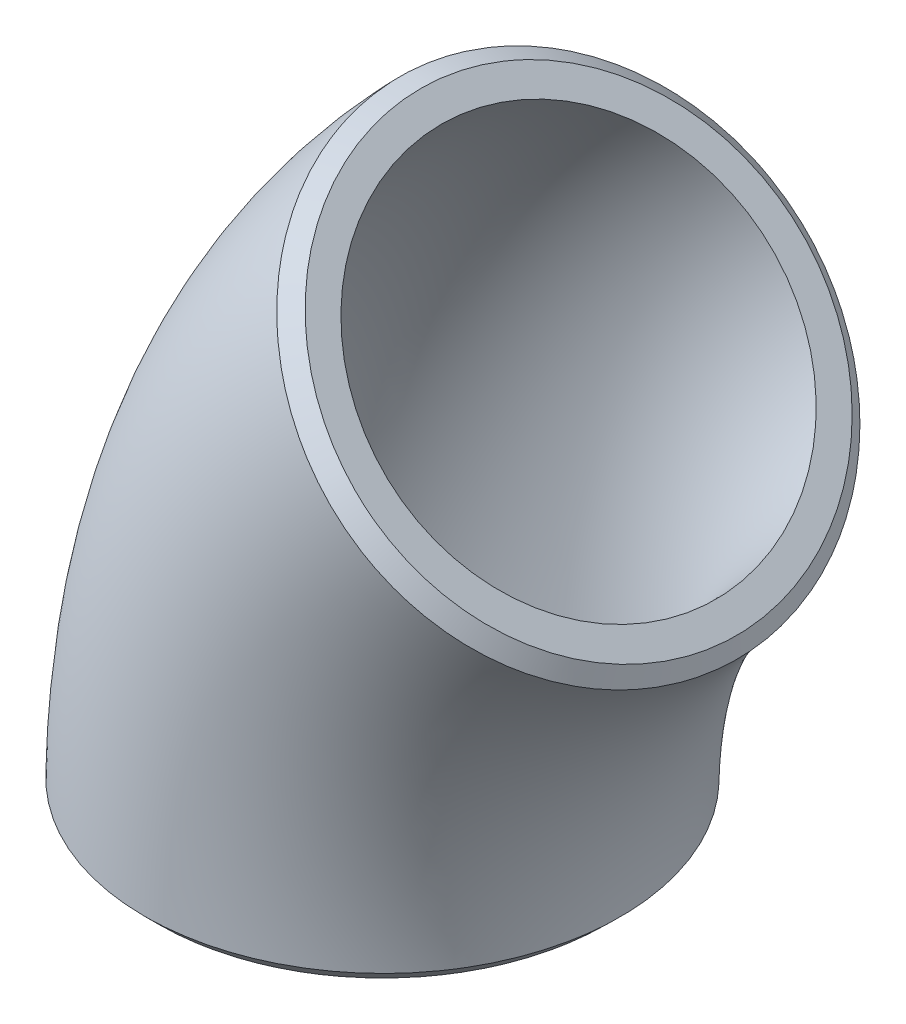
ISO-10303-21;
HEADER;
FILE_DESCRIPTION(('STEP AP214'),'2;1');
FILE_NAME('part.step','',(''),(''),'','','');
FILE_SCHEMA(('AUTOMOTIVE_DESIGN { 1 0 10303 214 1 1 1 1 }'));
ENDSEC;
DATA;
#1=APPLICATION_CONTEXT('core data for automotive mechanical design processes');
#2=APPLICATION_PROTOCOL_DEFINITION('international standard','automotive_design',2000,#1);
#3=PRODUCT_CONTEXT('',#1,'mechanical');
#4=PRODUCT('Part','Part','',(#3));
#5=PRODUCT_RELATED_PRODUCT_CATEGORY('part','',(#4));
#6=PRODUCT_DEFINITION_FORMATION('','',#4);
#7=PRODUCT_DEFINITION_CONTEXT('part definition',#1,'design');
#8=PRODUCT_DEFINITION('design','',#6,#7);
#9=PRODUCT_DEFINITION_SHAPE('','',#8);
#10=(LENGTH_UNIT() NAMED_UNIT(*) SI_UNIT(.MILLI.,.METRE.));
#11=(NAMED_UNIT(*) PLANE_ANGLE_UNIT() SI_UNIT($,.RADIAN.));
#12=(NAMED_UNIT(*) SI_UNIT($,.STERADIAN.) SOLID_ANGLE_UNIT());
#13=UNCERTAINTY_MEASURE_WITH_UNIT(LENGTH_MEASURE(1.E-05),#10,'distance_accuracy_value','');
#14=(GEOMETRIC_REPRESENTATION_CONTEXT(3) GLOBAL_UNCERTAINTY_ASSIGNED_CONTEXT((#13)) GLOBAL_UNIT_ASSIGNED_CONTEXT((#10,
#11,#12)) REPRESENTATION_CONTEXT('',''));
#15=CARTESIAN_POINT('',(0.,0.,0.));
#16=DIRECTION('',(0.,0.,1.));
#17=DIRECTION('',(1.,0.,0.));
#18=AXIS2_PLACEMENT_3D('',#15,#16,#17);
#19=CARTESIAN_POINT('',(0.,0.,0.));
#20=DIRECTION('',(0.,0.,1.));
#21=DIRECTION('',(1.,0.,0.));
#22=AXIS2_PLACEMENT_3D('',#19,#20,#21);
#23=TOROIDAL_SURFACE('',#22,84.49,30.);
#24=CARTESIAN_POINT('',(-61.0495371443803,58.4392352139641,29.9999923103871));
#25=CARTESIAN_POINT('',(-59.665627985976,57.0590372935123,30.0023138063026));
#26=CARTESIAN_POINT('',(-58.2540017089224,55.6514483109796,29.8072772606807));
#27=CARTESIAN_POINT('',(-55.5335550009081,52.939352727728,29.0425420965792));
#28=CARTESIAN_POINT('',(-54.2098315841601,51.6199759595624,28.4786617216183));
#29=CARTESIAN_POINT('',(-51.6285507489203,49.0477847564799,26.9742431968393));
#30=CARTESIAN_POINT('',(-50.3861116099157,47.810045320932,26.0367678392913));
#31=CARTESIAN_POINT('',(-48.0860388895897,45.5192605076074,23.8694856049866));
#32=CARTESIAN_POINT('',(-47.0081679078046,44.4460509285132,22.627772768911));
#33=CARTESIAN_POINT('',(-45.0199418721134,42.4669448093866,19.8271761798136));
#34=CARTESIAN_POINT('',(-44.1393781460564,41.5906982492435,18.3106781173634));
#35=CARTESIAN_POINT('',(-42.5987379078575,40.0579540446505,15.0683553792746));
#36=CARTESIAN_POINT('',(-41.9306582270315,39.3934993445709,13.3122375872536));
#37=CARTESIAN_POINT('',(-40.8613972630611,38.330219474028,9.67562266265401));
#38=CARTESIAN_POINT('',(-40.4590301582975,37.9302044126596,7.80793670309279));
#39=CARTESIAN_POINT('',(-39.9120829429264,37.3864902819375,3.96275696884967));
#40=CARTESIAN_POINT('',(-39.7721101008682,37.2473681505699,1.97094495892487));
#41=CARTESIAN_POINT('',(-39.7717649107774,37.247025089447,-1.93554565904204));
#42=CARTESIAN_POINT('',(-39.904254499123,37.3787089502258,-3.88117841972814));
#43=CARTESIAN_POINT('',(-40.4491023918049,37.9203345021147,-7.76372735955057));
#44=CARTESIAN_POINT('',(-40.8563906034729,38.3252417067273,-9.65286757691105));
#45=CARTESIAN_POINT('',(-41.9137327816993,39.3766676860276,-13.2603118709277));
#46=CARTESIAN_POINT('',(-42.5717991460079,40.031157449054,-15.0048936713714));
#47=CARTESIAN_POINT('',(-44.1289863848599,41.5803557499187,-18.2953800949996));
#48=CARTESIAN_POINT('',(-45.0086557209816,42.4557168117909,-19.8048108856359));
#49=CARTESIAN_POINT('',(-46.9638278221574,44.4019079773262,-22.5716385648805));
#50=CARTESIAN_POINT('',(-48.0596079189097,45.4929380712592,-23.8433366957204));
#51=CARTESIAN_POINT('',(-50.3687502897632,47.7927523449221,-26.0216246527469));
#52=CARTESIAN_POINT('',(-51.5873411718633,49.0067289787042,-26.9444353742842));
#53=CARTESIAN_POINT('',(-54.1631492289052,51.5734495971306,-28.4570531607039));
#54=CARTESIAN_POINT('',(-55.5129200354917,52.9187824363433,-29.0358651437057));
#55=CARTESIAN_POINT('',(-58.2236586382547,55.6211970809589,-29.7996107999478));
#56=CARTESIAN_POINT('',(-59.6089381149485,57.0025061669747,-29.996118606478));
#57=CARTESIAN_POINT('',(-63.8080940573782,61.1903813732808,-30.0076971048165));
#58=CARTESIAN_POINT('',(-66.6089419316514,63.9847211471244,-29.2098699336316));
#59=CARTESIAN_POINT('',(-70.4369631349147,67.8046593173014,-26.9718432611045));
#60=CARTESIAN_POINT('',(-71.675785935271,69.041009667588,-26.0391364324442));
#61=CARTESIAN_POINT('',(-73.9999798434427,71.3607610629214,-23.84401161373));
#62=CARTESIAN_POINT('',(-75.0674074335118,72.4262486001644,-22.603500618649));
#63=CARTESIAN_POINT('',(-77.0267465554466,74.382140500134,-19.8402457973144));
#64=CARTESIAN_POINT('',(-77.9265480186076,75.2804241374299,-18.2918144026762));
#65=CARTESIAN_POINT('',(-79.4641692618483,76.8155139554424,-15.0364721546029));
#66=CARTESIAN_POINT('',(-80.11713947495,77.4674435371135,-13.3157867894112));
#67=CARTESIAN_POINT('',(-81.1876687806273,78.5362918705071,-9.6704071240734));
#68=CARTESIAN_POINT('',(-81.5945602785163,78.9425596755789,-7.77032689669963));
#69=CARTESIAN_POINT('',(-82.1331751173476,79.4803528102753,-3.94176140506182));
#70=CARTESIAN_POINT('',(-82.2721431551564,79.6191118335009,-1.98526194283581));
#71=CARTESIAN_POINT('',(-82.272461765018,79.6194299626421,1.97805352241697));
#72=CARTESIAN_POINT('',(-82.13437334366,79.4815492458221,3.92656676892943));
#73=CARTESIAN_POINT('',(-81.5975389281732,78.9455337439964,7.75582980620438));
#74=CARTESIAN_POINT('',(-81.1885494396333,78.5371711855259,9.6661438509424));
#75=CARTESIAN_POINT('',(-80.1224929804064,77.472788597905,13.2988004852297));
#76=CARTESIAN_POINT('',(-79.4713023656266,76.8226354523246,15.0201267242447));
#77=CARTESIAN_POINT('',(-77.9298981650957,75.283768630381,18.2859766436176));
#78=CARTESIAN_POINT('',(-77.031860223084,74.3872454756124,19.8316473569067));
#79=CARTESIAN_POINT('',(-75.0767157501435,72.4355402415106,22.591730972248));
#80=CARTESIAN_POINT('',(-74.0085701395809,71.3693351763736,23.8353525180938));
#81=CARTESIAN_POINT('',(-71.6786263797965,69.0438444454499,26.0369987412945));
#82=CARTESIAN_POINT('',(-70.4472396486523,67.8149144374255,26.9642386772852));
#83=CARTESIAN_POINT('',(-67.8949085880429,65.2679721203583,28.4596217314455));
#84=CARTESIAN_POINT('',(-66.5547749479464,63.9308122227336,29.0368887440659));
#85=CARTESIAN_POINT('',(-63.8099057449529,61.1924387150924,29.8082692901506));
#86=CARTESIAN_POINT('',(-62.4334463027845,59.819433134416,29.9976708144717));
#87=CARTESIAN_POINT('',(-61.0495371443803,58.4392352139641,29.9999923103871));
#88=B_SPLINE_CURVE_WITH_KNOTS('',3,(#24,#25,#26,#27,#28,#29,#30,#31,#32,#33,#34,#35,#36,#37,#38,
#39,#40,#41,#42,#43,#44,#45,#46,#47,#48,#49,#50,#51,#52,#53,#54,#55,#56,#57,#58,#59,#60,#61,#62,
#63,#64,#65,#66,#67,#68,#69,#70,#71,#72,#73,#74,#75,#76,#77,#78,#79,#80,#81,#82,#83,#84,#85,#86,
#87),.UNSPECIFIED.,.T.,.F.,(4,2,2,2,2,2,2,2,2,2,2,2,2,2,2,2,2,2,2,2,2,2,2,2,2,2,2,2,2,2,2,4),
(-0.173063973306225,-0.167562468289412,-0.1620609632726,-0.156559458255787,-0.151057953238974,
-0.145556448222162,-0.140054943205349,-0.134553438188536,-0.129051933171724,-0.123550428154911,
-0.118048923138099,-0.112547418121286,-0.107045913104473,-0.101544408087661,-0.0960429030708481,
-0.0905413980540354,-0.0850398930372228,-0.0740368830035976,-0.0685353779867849,
-0.0630338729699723,-0.0575323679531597,-0.052030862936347,-0.0465293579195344,
-0.0410278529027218,-0.0355263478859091,-0.0300248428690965,-0.0245233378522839,
-0.0190218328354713,-0.0135203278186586,-0.008018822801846,-0.00251731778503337,
0.00298418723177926),.UNSPECIFIED.);
#89=CARTESIAN_POINT('',(-61.0495371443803,58.4392352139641,29.9999923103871));
#90=VERTEX_POINT('',#89);
#91=EDGE_CURVE('E46',#90,#90,#88,.F.);
#92=ORIENTED_EDGE('',*,*,#91,.T.);
#93=EDGE_LOOP('',(#92));
#94=FACE_BOUND('',#93,.T.);
#95=CARTESIAN_POINT('',(-84.491321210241,1.84576219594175,29.9999923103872));
#96=CARTESIAN_POINT('',(-84.9980168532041,1.84644286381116,29.9997903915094));
#97=CARTESIAN_POINT('',(-85.504676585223,1.84711174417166,29.9864833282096));
#98=CARTESIAN_POINT('',(-86.5192555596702,1.8484293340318,29.9340494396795));
#99=CARTESIAN_POINT('',(-87.0271680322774,1.8490779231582,29.8947911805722));
#100=CARTESIAN_POINT('',(-88.0403941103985,1.85035139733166,29.7908567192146));
#101=CARTESIAN_POINT('',(-88.5457076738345,1.85097628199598,29.7261801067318));
#102=CARTESIAN_POINT('',(-89.5498357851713,1.85219835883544,29.5713152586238));
#103=CARTESIAN_POINT('',(-90.0486701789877,1.8527956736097,29.4812559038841));
#104=CARTESIAN_POINT('',(-91.0387954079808,1.85396323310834,29.2764811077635));
#105=CARTESIAN_POINT('',(-91.5301106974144,1.85453359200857,29.1618837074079));
#106=CARTESIAN_POINT('',(-92.5061333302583,1.85565013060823,28.9082821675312));
#107=CARTESIAN_POINT('',(-92.9908439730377,1.85619632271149,28.7692907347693));
#108=CARTESIAN_POINT('',(-93.9537879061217,1.85726587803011,28.46654860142));
#109=CARTESIAN_POINT('',(-94.4320022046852,1.8577891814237,28.3027374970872));
#110=CARTESIAN_POINT('',(-95.3820987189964,1.85881451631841,27.9503704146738));
#111=CARTESIAN_POINT('',(-95.8539341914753,1.85931642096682,27.7616883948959));
#112=CARTESIAN_POINT('',(-96.7883975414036,1.86029706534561,27.3600166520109));
#113=CARTESIAN_POINT('',(-97.2510024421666,1.86077575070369,27.1469734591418));
#114=CARTESIAN_POINT('',(-98.1642264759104,1.86170851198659,26.6979606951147));
#115=CARTESIAN_POINT('',(-98.6148598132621,1.86216261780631,26.4620199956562));
#116=CARTESIAN_POINT('',(-99.502157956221,1.86304569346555,25.9685035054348));
#117=CARTESIAN_POINT('',(-99.9388643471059,1.86347474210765,25.7110025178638));
#118=CARTESIAN_POINT('',(-100.796433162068,1.86430722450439,25.1753049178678));
#119=CARTESIAN_POINT('',(-101.217362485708,1.86471077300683,24.8972153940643));
#120=CARTESIAN_POINT('',(-102.044844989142,1.86549523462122,24.3202273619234));
#121=CARTESIAN_POINT('',(-102.451394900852,1.86587614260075,24.021324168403));
#122=CARTESIAN_POINT('',(-103.250157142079,1.86661651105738,23.4024641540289));
#123=CARTESIAN_POINT('',(-103.642321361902,1.866975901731,23.082445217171));
#124=CARTESIAN_POINT('',(-104.411696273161,1.86767377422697,22.4214197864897));
#125=CARTESIAN_POINT('',(-104.78882961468,1.86801215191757,22.0803232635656));
#126=CARTESIAN_POINT('',(-105.526859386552,1.8686679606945,21.3779167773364));
#127=CARTESIAN_POINT('',(-105.887679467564,1.86898529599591,21.0165265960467));
#128=CARTESIAN_POINT('',(-106.588570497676,1.86959618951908,20.2777926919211));
#129=CARTESIAN_POINT('',(-106.928741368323,1.86988986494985,19.9005437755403));
#130=CARTESIAN_POINT('',(-107.587790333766,1.87045395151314,19.1310982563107));
#131=CARTESIAN_POINT('',(-107.906765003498,1.87072447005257,18.7389843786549));
#132=CARTESIAN_POINT('',(-108.52369112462,1.87124353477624,17.9402162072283));
#133=CARTESIAN_POINT('',(-108.821695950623,1.87149213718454,17.5336031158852));
#134=CARTESIAN_POINT('',(-109.397314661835,1.87196897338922,16.7055997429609));
#135=CARTESIAN_POINT('',(-109.674908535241,1.87219718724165,16.2841955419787));
#136=CARTESIAN_POINT('',(-110.209764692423,1.87263398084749,15.4251852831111));
#137=CARTESIAN_POINT('',(-110.466895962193,1.87284243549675,14.9874976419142));
#138=CARTESIAN_POINT('',(-110.959603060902,1.87323944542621,14.0983749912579));
#139=CARTESIAN_POINT('',(-111.195109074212,1.87342793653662,13.6469013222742));
#140=CARTESIAN_POINT('',(-111.642861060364,1.87378433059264,12.7327266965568));
#141=CARTESIAN_POINT('',(-111.855114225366,1.87395223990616,12.2700292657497));
#142=CARTESIAN_POINT('',(-112.254797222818,1.87426695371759,11.3361107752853));
#143=CARTESIAN_POINT('',(-112.442317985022,1.87441383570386,10.8649286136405));
#144=CARTESIAN_POINT('',(-112.79270048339,1.87468718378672,9.91573930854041));
#145=CARTESIAN_POINT('',(-112.955662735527,1.87481373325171,9.43776926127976));
#146=CARTESIAN_POINT('',(-113.256919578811,1.87504680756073,8.4747970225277));
#147=CARTESIAN_POINT('',(-113.395245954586,1.87515335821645,7.9898047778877));
#148=CARTESIAN_POINT('',(-113.647606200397,1.87534715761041,7.01266532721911));
#149=CARTESIAN_POINT('',(-113.761598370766,1.87543437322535,6.52050735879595));
#150=CARTESIAN_POINT('',(-113.96507912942,1.87558978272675,5.52865793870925));
#151=CARTESIAN_POINT('',(-114.054446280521,1.87565788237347,5.02894153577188));
#152=CARTESIAN_POINT('',(-114.207761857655,1.87577453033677,4.02373726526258));
#153=CARTESIAN_POINT('',(-114.271614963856,1.87582300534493,3.51823488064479));
#154=CARTESIAN_POINT('',(-114.373828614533,1.87590048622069,2.50510213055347));
#155=CARTESIAN_POINT('',(-114.412211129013,1.87592950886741,1.99747398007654));
#156=CARTESIAN_POINT('',(-114.462801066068,1.87596771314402,0.983686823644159));
#157=CARTESIAN_POINT('',(-114.475150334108,1.87597700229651,0.477534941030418));
#158=CARTESIAN_POINT('',(-114.474084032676,1.87597619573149,-0.532343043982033));
#159=CARTESIAN_POINT('',(-114.460789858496,1.87596619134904,-1.03606931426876));
#160=CARTESIAN_POINT('',(-114.409084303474,1.87592714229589,-2.04267683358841));
#161=CARTESIAN_POINT('',(-114.370650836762,1.87589808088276,-2.54555694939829));
#162=CARTESIAN_POINT('',(-114.268144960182,1.87582037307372,-3.55055686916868));
#163=CARTESIAN_POINT('',(-114.203979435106,1.87577165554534,-4.05266719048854));
#164=CARTESIAN_POINT('',(-114.04984404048,1.87565437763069,-5.05618514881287));
#165=CARTESIAN_POINT('',(-113.959712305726,1.87558569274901,-5.55756790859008));
#166=CARTESIAN_POINT('',(-113.753994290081,1.87542855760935,-6.55537719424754));
#167=CARTESIAN_POINT('',(-113.638393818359,1.87534009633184,-7.05180079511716));
#168=CARTESIAN_POINT('',(-113.382527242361,1.87514356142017,-8.03621012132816));
#169=CARTESIAN_POINT('',(-113.242357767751,1.87503556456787,-8.52422096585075));
#170=CARTESIAN_POINT('',(-112.938011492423,1.87480004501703,-9.49078924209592));
#171=CARTESIAN_POINT('',(-112.773921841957,1.87467259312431,-9.96937412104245));
#172=CARTESIAN_POINT('',(-112.42233992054,1.87439821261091,-10.9161892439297));
#173=CARTESIAN_POINT('',(-112.234921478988,1.87425134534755,-11.3844468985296));
#174=CARTESIAN_POINT('',(-111.836220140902,1.87393729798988,-12.3118391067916));
#175=CARTESIAN_POINT('',(-111.624888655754,1.87377007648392,-12.7709527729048));
#176=CARTESIAN_POINT('',(-111.178515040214,1.87341469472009,-13.6796142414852));
#177=CARTESIAN_POINT('',(-110.943388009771,1.87322645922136,-14.1291203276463));
#178=CARTESIAN_POINT('',(-110.449921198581,1.87282870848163,-15.0170850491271));
#179=CARTESIAN_POINT('',(-110.19150981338,1.87261912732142,-15.4555039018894));
#180=CARTESIAN_POINT('',(-109.652117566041,1.87217848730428,-16.3194374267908));
#181=CARTESIAN_POINT('',(-109.37109304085,1.87194738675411,-16.7449248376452));
#182=CARTESIAN_POINT('',(-108.789335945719,1.87146520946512,-17.5788736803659));
#183=CARTESIAN_POINT('',(-108.488715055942,1.8712142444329,-17.9874130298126));
#184=CARTESIAN_POINT('',(-107.868523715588,1.87069202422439,-18.7867963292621));
#185=CARTESIAN_POINT('',(-107.549048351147,1.87042086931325,-19.1777140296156));
#186=CARTESIAN_POINT('',(-106.891330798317,1.86985751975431,-19.9422136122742));
#187=CARTESIAN_POINT('',(-106.553122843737,1.86956536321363,-20.3158249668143));
#188=CARTESIAN_POINT('',(-105.857905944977,1.86895912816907,-21.046479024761));
#189=CARTESIAN_POINT('',(-105.500862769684,1.86864500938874,-21.4034891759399));
#190=CARTESIAN_POINT('',(-104.766444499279,1.86799214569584,-22.100996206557));
#191=CARTESIAN_POINT('',(-104.388949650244,1.86765325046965,-22.4413670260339));
#192=CARTESIAN_POINT('',(-103.616252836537,1.86695203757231,-23.1036418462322));
#193=CARTESIAN_POINT('',(-103.221003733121,1.86658965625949,-23.425490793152));
#194=CARTESIAN_POINT('',(-102.415595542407,1.86584276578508,-24.0481586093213));
#195=CARTESIAN_POINT('',(-102.005469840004,1.86545830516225,-24.3490206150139));
#196=CARTESIAN_POINT('',(-101.172634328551,1.86466808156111,-24.9274440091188));
#197=CARTESIAN_POINT('',(-100.750011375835,1.86426245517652,-25.2051305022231));
#198=CARTESIAN_POINT('',(-99.8926084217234,1.86342937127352,-25.7383635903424));
#199=CARTESIAN_POINT('',(-99.4578642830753,1.86300197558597,-25.9939678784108));
#200=CARTESIAN_POINT('',(-98.5757654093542,1.86212343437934,-26.4829778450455));
#201=CARTESIAN_POINT('',(-98.1284043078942,1.86167227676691,-26.7163720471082));
#202=CARTESIAN_POINT('',(-97.2208869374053,1.8607446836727,-27.1610718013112));
#203=CARTESIAN_POINT('',(-96.7606911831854,1.86026816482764,-27.3722967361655));
#204=CARTESIAN_POINT('',(-95.8279881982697,1.85928890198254,-27.7722349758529));
#205=CARTESIAN_POINT('',(-95.355432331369,1.85878604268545,-27.9608349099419));
#206=CARTESIAN_POINT('',(-94.4008902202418,1.85775532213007,-28.3137385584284));
#207=CARTESIAN_POINT('',(-93.9188964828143,1.85722744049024,-28.4780220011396));
#208=CARTESIAN_POINT('',(-92.9481764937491,1.85614843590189,-28.7817693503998));
#209=CARTESIAN_POINT('',(-92.4594650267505,1.85559735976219,-28.9212805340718));
#210=CARTESIAN_POINT('',(-91.4778497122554,1.85447338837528,-29.1747278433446));
#211=CARTESIAN_POINT('',(-90.9849755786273,1.8539006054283,-29.2887789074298));
#212=CARTESIAN_POINT('',(-89.9957187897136,1.85273250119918,-29.4911749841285));
#213=CARTESIAN_POINT('',(-89.4993536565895,1.85213726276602,-29.5796056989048));
#214=CARTESIAN_POINT('',(-88.501665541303,1.85092158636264,-29.7316619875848));
#215=CARTESIAN_POINT('',(-88.0003337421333,1.85030109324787,-29.795229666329));
#216=CARTESIAN_POINT('',(-86.9934228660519,1.84903435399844,-29.8971991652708));
#217=CARTESIAN_POINT('',(-86.4878351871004,1.84838802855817,-29.935515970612));
#218=CARTESIAN_POINT('',(-85.4731841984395,1.84706966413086,-29.9869799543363));
#219=CARTESIAN_POINT('',(-84.9641153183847,1.84639752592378,-30.0000174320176));
#220=CARTESIAN_POINT('',(-83.9447706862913,1.84502776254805,-29.9999752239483));
#221=CARTESIAN_POINT('',(-83.4344949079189,1.84433008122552,-29.9868341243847));
#222=CARTESIAN_POINT('',(-82.4155428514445,1.84291136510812,-29.9340575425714));
#223=CARTESIAN_POINT('',(-81.9068659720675,1.84219034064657,-29.8944336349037));
#224=CARTESIAN_POINT('',(-80.8925945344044,1.84072723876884,-29.7893576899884));
#225=CARTESIAN_POINT('',(-80.3869978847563,1.83998517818,-29.7239257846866));
#226=CARTESIAN_POINT('',(-79.3803761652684,1.83848181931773,-29.5676521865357));
#227=CARTESIAN_POINT('',(-78.8793462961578,1.83772054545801,-29.4768413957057));
#228=CARTESIAN_POINT('',(-77.8833466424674,1.83618070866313,-29.2702936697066));
#229=CARTESIAN_POINT('',(-77.3883679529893,1.83540217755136,-29.1545996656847));
#230=CARTESIAN_POINT('',(-76.4059637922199,1.83382972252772,-28.8987434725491));
#231=CARTESIAN_POINT('',(-75.9185238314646,1.83303583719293,-28.7586369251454));
#232=CARTESIAN_POINT('',(-74.9526814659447,1.83143464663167,-28.4544430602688));
#233=CARTESIAN_POINT('',(-74.4742575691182,1.83062738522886,-28.2904240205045));
#234=CARTESIAN_POINT('',(-73.5278225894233,1.82900091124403,-27.9387415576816));
#235=CARTESIAN_POINT('',(-73.0597843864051,1.82818174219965,-27.7511511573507));
#236=CARTESIAN_POINT('',(-72.1324554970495,1.82652876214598,-27.351771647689));
#237=CARTESIAN_POINT('',(-71.6731959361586,1.82569491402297,-27.1399102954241));
#238=CARTESIAN_POINT('',(-70.7640056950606,1.82401493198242,-26.6924096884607));
#239=CARTESIAN_POINT('',(-70.3141226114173,1.82316876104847,-26.4566737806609));
#240=CARTESIAN_POINT('',(-69.4257235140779,1.82146856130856,-25.9621950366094));
#241=CARTESIAN_POINT('',(-68.9872382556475,1.82061451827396,-25.7033969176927));
#242=CARTESIAN_POINT('',(-68.1239757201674,1.81890343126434,-25.1636161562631));
#243=CARTESIAN_POINT('',(-67.6992022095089,1.81804638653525,-24.8826274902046));
#244=CARTESIAN_POINT('',(-66.8666292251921,1.81633756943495,-24.3010182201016));
#245=CARTESIAN_POINT('',(-66.4587524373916,1.81548579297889,-24.0005082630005));
#246=CARTESIAN_POINT('',(-65.6603721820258,1.81379073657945,-23.3803997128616));
#247=CARTESIAN_POINT('',(-65.2698060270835,1.81294743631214,-23.0608818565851));
#248=CARTESIAN_POINT('',(-64.5057028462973,1.81127098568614,-22.4028516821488));
#249=CARTESIAN_POINT('',(-64.1321493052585,1.81043782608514,-22.0643585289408));
#250=CARTESIAN_POINT('',(-63.4013786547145,1.80878251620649,-21.3683179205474));
#251=CARTESIAN_POINT('',(-63.0442063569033,1.80796040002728,-21.0107233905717));
#252=CARTESIAN_POINT('',(-62.3465225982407,1.80632970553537,-20.2752935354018));
#253=CARTESIAN_POINT('',(-62.0061315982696,1.8055212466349,-19.8973439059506));
#254=CARTESIAN_POINT('',(-61.3440451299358,1.80392627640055,-19.1239699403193));
#255=CARTESIAN_POINT('',(-61.0223928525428,1.80313981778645,-18.728508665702));
#256=CARTESIAN_POINT('',(-60.400367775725,1.80159814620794,-17.9229965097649));
#257=CARTESIAN_POINT('',(-60.0999361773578,1.80084284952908,-17.5129910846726));
#258=CARTESIAN_POINT('',(-59.5225364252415,1.79937180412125,-16.6806441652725));
#259=CARTESIAN_POINT('',(-59.2454311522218,1.79865583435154,-16.2583977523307));
#260=CARTESIAN_POINT('',(-58.7130749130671,1.79726415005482,-15.4014723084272));
#261=CARTESIAN_POINT('',(-58.457783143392,1.79658836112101,-14.9668186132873));
#262=CARTESIAN_POINT('',(-57.9691636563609,1.79528056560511,-14.0845172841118));
#263=CARTESIAN_POINT('',(-57.7358677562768,1.79464862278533,-13.6368520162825));
#264=CARTESIAN_POINT('',(-57.291223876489,1.79343189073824,-12.7282933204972));
#265=CARTESIAN_POINT('',(-57.0799778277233,1.79284732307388,-12.2673500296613));
#266=CARTESIAN_POINT('',(-56.6800874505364,1.79173067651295,-11.3331482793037));
#267=CARTESIAN_POINT('',(-56.4915560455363,1.79119886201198,-10.8598414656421));
#268=CARTESIAN_POINT('',(-56.1391279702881,1.79019693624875,-9.90465667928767));
#269=CARTESIAN_POINT('',(-55.9752080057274,1.7897267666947,-9.42278730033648));
#270=CARTESIAN_POINT('',(-55.6723595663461,1.78885194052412,-8.45266350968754));
#271=CARTESIAN_POINT('',(-55.533365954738,1.78844711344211,-7.96442942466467));
#272=CARTESIAN_POINT('',(-55.2808705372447,1.78770732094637,-6.98357595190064));
#273=CARTESIAN_POINT('',(-55.1672650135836,1.78737207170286,-6.4909832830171));
#274=CARTESIAN_POINT('',(-54.9654815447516,1.78677436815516,-5.50188679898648));
#275=CARTESIAN_POINT('',(-54.8772415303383,1.78651173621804,-5.00539563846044));
#276=CARTESIAN_POINT('',(-54.7255560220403,1.78605894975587,-4.0072948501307));
#277=CARTESIAN_POINT('',(-54.6621768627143,1.78586898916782,-3.50567514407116));
#278=CARTESIAN_POINT('',(-54.5606865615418,1.78556392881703,-2.49796457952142));
#279=CARTESIAN_POINT('',(-54.522671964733,1.78544911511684,-1.99186398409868));
#280=CARTESIAN_POINT('',(-54.4722877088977,1.78529659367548,-0.975891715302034));
#281=CARTESIAN_POINT('',(-54.4600451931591,1.78525926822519,-0.466013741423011));
#282=CARTESIAN_POINT('',(-54.4615116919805,1.78526369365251,0.553135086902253));
#283=CARTESIAN_POINT('',(-54.4751917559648,1.7853053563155,1.062405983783));
#284=CARTESIAN_POINT('',(-54.5283507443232,1.78546621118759,2.07643750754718));
#285=CARTESIAN_POINT('',(-54.5676692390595,1.78558492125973,2.58120652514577));
#286=CARTESIAN_POINT('',(-54.6717445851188,1.78589765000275,3.58624363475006));
#287=CARTESIAN_POINT('',(-54.7364078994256,1.7860913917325,4.08652143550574));
#288=CARTESIAN_POINT('',(-54.8904915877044,1.78655119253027,5.08268653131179));
#289=CARTESIAN_POINT('',(-54.9798845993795,1.78681717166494,5.5785780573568));
#290=CARTESIAN_POINT('',(-55.1842979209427,1.78742236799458,6.56762323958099));
#291=CARTESIAN_POINT('',(-55.2994431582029,1.78776194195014,7.06075111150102));
#292=CARTESIAN_POINT('',(-55.5552026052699,1.78851075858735,8.04295131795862));
#293=CARTESIAN_POINT('',(-55.6959399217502,1.78892033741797,8.53199154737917));
#294=CARTESIAN_POINT('',(-56.0019679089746,1.78980364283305,9.50286465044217));
#295=CARTESIAN_POINT('',(-56.1672826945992,1.79027743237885,9.98468992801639));
#296=CARTESIAN_POINT('',(-56.5219719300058,1.79128483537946,10.9378177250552));
#297=CARTESIAN_POINT('',(-56.7112753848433,1.79181827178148,11.4091466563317));
#298=CARTESIAN_POINT('',(-57.1125271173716,1.79293758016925,12.3394318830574));
#299=CARTESIAN_POINT('',(-57.3243648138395,1.79352319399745,12.7984359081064));
#300=CARTESIAN_POINT('',(-57.7704396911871,1.79474260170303,13.7041416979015));
#301=CARTESIAN_POINT('',(-58.0046250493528,1.79537628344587,14.1508689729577));
#302=CARTESIAN_POINT('',(-58.4954955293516,1.7966886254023,15.0322142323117));
#303=CARTESIAN_POINT('',(-58.7521972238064,1.79736731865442,15.4668229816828));
#304=CARTESIAN_POINT('',(-59.2879746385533,1.79876612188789,16.3242957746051));
#305=CARTESIAN_POINT('',(-59.5671306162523,1.79948637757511,16.7471096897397));
#306=CARTESIAN_POINT('',(-60.148124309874,1.80096445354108,17.5797475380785));
#307=CARTESIAN_POINT('',(-60.4500601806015,1.80172243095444,17.9895030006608));
#308=CARTESIAN_POINT('',(-61.0745038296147,1.80326775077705,18.7935964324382));
#309=CARTESIAN_POINT('',(-61.3970296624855,1.80405511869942,19.1879203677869));
#310=CARTESIAN_POINT('',(-62.0604507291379,1.80565074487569,19.9585205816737));
#311=CARTESIAN_POINT('',(-62.4012809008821,1.80645892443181,20.3348528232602));
#312=CARTESIAN_POINT('',(-63.0996680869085,1.80808860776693,21.0670702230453));
#313=CARTESIAN_POINT('',(-63.4571041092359,1.80890999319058,21.4230708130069));
#314=CARTESIAN_POINT('',(-64.1888818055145,1.81056492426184,22.116507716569));
#315=CARTESIAN_POINT('',(-64.5632066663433,1.81139845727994,22.4539617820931));
#316=CARTESIAN_POINT('',(-65.3293768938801,1.81307670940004,23.1103942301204));
#317=CARTESIAN_POINT('',(-65.7212642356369,1.81392145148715,23.4293236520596));
#318=CARTESIAN_POINT('',(-66.5227798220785,1.81562022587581,24.0485192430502));
#319=CARTESIAN_POINT('',(-66.9324898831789,1.81647428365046,24.3486794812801));
#320=CARTESIAN_POINT('',(-67.7686789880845,1.81818727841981,24.9293457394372));
#321=CARTESIAN_POINT('',(-68.195232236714,1.81904621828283,25.2097449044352));
#322=CARTESIAN_POINT('',(-69.0604461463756,1.82075780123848,25.7473744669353));
#323=CARTESIAN_POINT('',(-69.4990544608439,1.82161045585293,26.0046891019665));
#324=CARTESIAN_POINT('',(-70.3870031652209,1.82330643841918,26.4957204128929));
#325=CARTESIAN_POINT('',(-70.836293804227,1.82414979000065,26.7295270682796));
#326=CARTESIAN_POINT('',(-71.7446314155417,1.82582488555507,27.1734379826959));
#327=CARTESIAN_POINT('',(-72.2036420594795,1.82665665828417,27.3836165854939));
#328=CARTESIAN_POINT('',(-73.1314186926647,1.82830787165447,27.7804723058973));
#329=CARTESIAN_POINT('',(-73.6001792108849,1.82912731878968,27.9671622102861));
#330=CARTESIAN_POINT('',(-74.5485124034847,1.83075567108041,28.3172946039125));
#331=CARTESIAN_POINT('',(-75.0281218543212,1.83156451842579,28.4806374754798));
#332=CARTESIAN_POINT('',(-75.9965691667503,1.83316913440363,28.7834545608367));
#333=CARTESIAN_POINT('',(-76.485432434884,1.83396485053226,28.9228475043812));
#334=CARTESIAN_POINT('',(-77.4707518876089,1.83554032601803,29.1769238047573));
#335=CARTESIAN_POINT('',(-77.9672230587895,1.83632004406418,29.2915490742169));
#336=CARTESIAN_POINT('',(-78.9644156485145,1.83785831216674,29.4951435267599));
#337=CARTESIAN_POINT('',(-79.4651272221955,1.83861689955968,29.5841609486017));
#338=CARTESIAN_POINT('',(-80.4675272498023,1.84010924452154,29.7362524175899));
#339=CARTESIAN_POINT('',(-80.9691934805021,1.84084311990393,29.7994728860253));
#340=CARTESIAN_POINT('',(-81.9736387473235,1.84228734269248,29.900222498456));
#341=CARTESIAN_POINT('',(-82.4764104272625,1.84299775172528,29.9378250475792));
#342=CARTESIAN_POINT('',(-83.4832345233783,1.84439661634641,29.9877958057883));
#343=CARTESIAN_POINT('',(-83.9872870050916,1.8450850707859,30.0001626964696));
#344=CARTESIAN_POINT('',(-84.491321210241,1.84576219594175,29.9999923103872));
#345=B_SPLINE_CURVE_WITH_KNOTS('',3,(#95,#96,#97,#98,#99,#100,#101,#102,#103,#104,#105,#106,
#107,#108,#109,#110,#111,#112,#113,#114,#115,#116,#117,#118,#119,#120,#121,#122,#123,#124,#125,
#126,#127,#128,#129,#130,#131,#132,#133,#134,#135,#136,#137,#138,#139,#140,#141,#142,#143,#144,
#145,#146,#147,#148,#149,#150,#151,#152,#153,#154,#155,#156,#157,#158,#159,#160,#161,#162,#163,
#164,#165,#166,#167,#168,#169,#170,#171,#172,#173,#174,#175,#176,#177,#178,#179,#180,#181,#182,
#183,#184,#185,#186,#187,#188,#189,#190,#191,#192,#193,#194,#195,#196,#197,#198,#199,#200,#201,
#202,#203,#204,#205,#206,#207,#208,#209,#210,#211,#212,#213,#214,#215,#216,#217,#218,#219,#220,
#221,#222,#223,#224,#225,#226,#227,#228,#229,#230,#231,#232,#233,#234,#235,#236,#237,#238,#239,
#240,#241,#242,#243,#244,#245,#246,#247,#248,#249,#250,#251,#252,#253,#254,#255,#256,#257,#258,
#259,#260,#261,#262,#263,#264,#265,#266,#267,#268,#269,#270,#271,#272,#273,#274,#275,#276,#277,
#278,#279,#280,#281,#282,#283,#284,#285,#286,#287,#288,#289,#290,#291,#292,#293,#294,#295,#296,
#297,#298,#299,#300,#301,#302,#303,#304,#305,#306,#307,#308,#309,#310,#311,#312,#313,#314,#315,
#316,#317,#318,#319,#320,#321,#322,#323,#324,#325,#326,#327,#328,#329,#330,#331,#332,#333,#334,
#335,#336,#337,#338,#339,#340,#341,#342,#343,#344),.UNSPECIFIED.,.F.,.F.,(4,2,2,2,2,2,2,2,2,2,2,
2,2,2,2,2,2,2,2,2,2,2,2,2,2,2,2,2,2,2,2,2,2,2,2,2,2,2,2,2,2,2,2,2,2,2,2,2,2,2,2,2,2,2,2,2,2,2,2,
2,2,2,2,2,2,2,2,2,2,2,2,2,2,2,2,2,2,2,2,2,2,2,2,2,2,2,2,2,2,2,2,2,2,2,2,2,2,2,2,2,2,2,2,2,2,2,2,
2,2,2,2,2,2,2,2,2,2,2,2,2,2,2,2,2,4),(0.,1.51987243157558,3.04750208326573,4.57515639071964,
6.09518960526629,7.60806865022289,9.12016196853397,10.6359962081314,12.1598311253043,
13.6870773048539,15.2124221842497,16.7326783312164,18.2455181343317,19.7586995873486,
21.2765500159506,22.8014042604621,24.3327807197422,25.8560330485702,27.3717868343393,
28.8835314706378,30.3967390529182,31.9189638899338,33.4459419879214,34.9724464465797,
36.4931721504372,38.0074939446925,39.5198476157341,41.0347724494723,42.5570395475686,
44.0849417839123,45.6115243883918,47.1297674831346,48.6408408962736,50.1532436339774,
51.67116933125,53.1987699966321,54.7272239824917,56.2497962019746,57.7669536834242,
59.2794263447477,60.7950293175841,62.316244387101,63.8423085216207,65.371393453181,
66.892419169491,68.406339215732,69.9175784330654,71.4316657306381,72.9558543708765,
74.4843614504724,76.0096281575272,77.5260419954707,79.0383659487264,80.5514671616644,
82.0698927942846,83.595634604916,85.122641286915,86.6467016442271,88.1637359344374,
89.6756354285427,91.1910348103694,92.7115105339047,94.2385697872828,95.7692156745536,
97.2991930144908,98.8279792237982,100.3549119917,101.879231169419,103.40012047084,
104.916749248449,106.428790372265,107.945455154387,109.468526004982,110.995351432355,
112.522592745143,114.041827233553,115.555014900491,117.066700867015,118.582301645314,
120.107545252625,121.636175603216,123.160389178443,124.674905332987,126.186523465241,
127.700295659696,129.220781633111,130.748539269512,132.274841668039,133.797095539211,
135.313012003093,136.825186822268,138.341369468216,139.863290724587,141.392702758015,
142.920407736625,144.438643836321,145.951328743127,147.462346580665,148.980859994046,
150.506881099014,152.034409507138,153.557518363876,155.073470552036,156.585989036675,
158.099630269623,159.61894504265,161.145227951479,162.672868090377,164.195397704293,
165.708184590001,167.219497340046,168.734637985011,170.257675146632,171.788400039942,
173.313290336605,174.83210197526,176.345992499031,177.859055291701,179.378392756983,
180.902788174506,182.430720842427,183.955756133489,185.472010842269,186.98390241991,
188.495872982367),.UNSPECIFIED.);
#346=CARTESIAN_POINT('',(-84.491321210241,1.84576219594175,29.9999923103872));
#347=VERTEX_POINT('',#346);
#348=EDGE_CURVE('E51',#347,#347,#345,.F.);
#349=ORIENTED_EDGE('',*,*,#348,.T.);
#350=EDGE_LOOP('',(#349));
#351=FACE_BOUND('',#350,.T.);
#352=ADVANCED_FACE('F34',(#94,#351),#23,.T.);
#353=CARTESIAN_POINT('',(-59.7434519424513,59.7434519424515,0.));
#354=DIRECTION('',(0.707106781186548,0.707106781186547,0.));
#355=DIRECTION('',(0.,0.,1.));
#356=AXIS2_PLACEMENT_3D('',#353,#354,#355);
#357=PLANE('',#356);
#358=CARTESIAN_POINT('',(-59.7434519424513,59.7434519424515,28.1542594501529));
#359=CARTESIAN_POINT('',(-60.0778804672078,60.077880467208,28.1537415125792));
#360=CARTESIAN_POINT('',(-60.4123092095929,60.4123092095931,28.1414628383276));
#361=CARTESIAN_POINT('',(-61.0803609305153,61.0803609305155,28.0932270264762));
#362=CARTESIAN_POINT('',(-61.4139837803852,61.4139837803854,28.0572663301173));
#363=CARTESIAN_POINT('',(-62.0805360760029,62.0805360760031,27.9613628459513));
#364=CARTESIAN_POINT('',(-62.4134602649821,62.4134602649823,27.9013469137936));
#365=CARTESIAN_POINT('',(-63.0787131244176,63.0787131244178,27.7572098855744));
#366=CARTESIAN_POINT('',(-63.4110265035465,63.4110265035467,27.6729476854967));
#367=CARTESIAN_POINT('',(-64.0727337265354,64.0727337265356,27.4804589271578));
#368=CARTESIAN_POINT('',(-64.4021218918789,64.4021218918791,27.3721933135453));
#369=CARTESIAN_POINT('',(-65.0557097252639,65.0557097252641,27.1324000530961));
#370=CARTESIAN_POINT('',(-65.3799207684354,65.3799207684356,27.0009343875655));
#371=CARTESIAN_POINT('',(-66.0221412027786,66.0221412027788,26.7154617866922));
#372=CARTESIAN_POINT('',(-66.3401678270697,66.3401678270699,26.5615323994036));
#373=CARTESIAN_POINT('',(-66.969047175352,66.9690471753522,26.231684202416));
#374=CARTESIAN_POINT('',(-67.2799231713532,67.2799231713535,26.0558541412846));
#375=CARTESIAN_POINT('',(-67.8952697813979,67.8952697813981,25.68210006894));
#376=CARTESIAN_POINT('',(-68.1997347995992,68.1997347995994,25.4841576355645));
#377=CARTESIAN_POINT('',(-68.8022369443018,68.802236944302,25.066144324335));
#378=CARTESIAN_POINT('',(-69.1002491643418,69.1002491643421,24.8460016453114));
#379=CARTESIAN_POINT('',(-69.6891514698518,69.689151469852,24.3837772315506));
#380=CARTESIAN_POINT('',(-69.9800095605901,69.9800095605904,24.1416139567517));
#381=CARTESIAN_POINT('',(-70.5536340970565,70.5536340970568,23.6357810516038));
#382=CARTESIAN_POINT('',(-70.8363686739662,70.8363686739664,23.3720391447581));
#383=CARTESIAN_POINT('',(-71.3905679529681,71.3905679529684,22.8259602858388));
#384=CARTESIAN_POINT('',(-71.662082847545,71.6620828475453,22.5437252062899));
#385=CARTESIAN_POINT('',(-72.1932290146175,72.1932290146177,21.9615524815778));
#386=CARTESIAN_POINT('',(-72.4529140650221,72.4529140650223,21.661712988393));
#387=CARTESIAN_POINT('',(-72.9606144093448,72.960614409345,21.0445896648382));
#388=CARTESIAN_POINT('',(-73.208656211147,73.2086562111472,20.7273494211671));
#389=CARTESIAN_POINT('',(-73.6935702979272,73.6935702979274,20.0754463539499));
#390=CARTESIAN_POINT('',(-73.9304292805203,73.9304292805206,19.7407637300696));
#391=CARTESIAN_POINT('',(-74.3931970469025,74.3931970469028,19.0523983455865));
#392=CARTESIAN_POINT('',(-74.6190240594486,74.6190240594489,18.6986056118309));
#393=CARTESIAN_POINT('',(-75.0585328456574,75.0585328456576,17.9742410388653));
#394=CARTESIAN_POINT('',(-75.272172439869,75.2721724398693,17.6036180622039));
#395=CARTESIAN_POINT('',(-75.6857003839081,75.6857003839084,16.8480065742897));
#396=CARTESIAN_POINT('',(-75.8856043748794,75.8856043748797,16.4630351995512));
#397=CARTESIAN_POINT('',(-76.2701497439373,76.2701497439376,15.6809150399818));
#398=CARTESIAN_POINT('',(-76.4548605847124,76.4548605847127,15.2838345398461));
#399=CARTESIAN_POINT('',(-76.8093722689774,76.8093722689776,14.478522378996));
#400=CARTESIAN_POINT('',(-76.9792233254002,76.9792233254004,14.0703349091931));
#401=CARTESIAN_POINT('',(-77.3040086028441,77.3040086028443,13.2425079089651));
#402=CARTESIAN_POINT('',(-77.4589499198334,77.4589499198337,12.8228739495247));
#403=CARTESIAN_POINT('',(-77.7540556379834,77.7540556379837,11.9720260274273));
#404=CARTESIAN_POINT('',(-77.8941816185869,77.8941816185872,11.5407854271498));
#405=CARTESIAN_POINT('',(-78.1595318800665,78.1595318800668,10.6667955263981));
#406=CARTESIAN_POINT('',(-78.2846821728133,78.2846821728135,10.2240012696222));
#407=CARTESIAN_POINT('',(-78.5190516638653,78.5190516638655,9.32880820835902));
#408=CARTESIAN_POINT('',(-78.6282304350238,78.628230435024,8.87638824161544));
#409=CARTESIAN_POINT('',(-78.8302276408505,78.8302276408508,7.96489696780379));
#410=CARTESIAN_POINT('',(-78.9230653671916,78.9230653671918,7.50583420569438));
#411=CARTESIAN_POINT('',(-79.0916850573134,79.0916850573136,6.58387083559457));
#412=CARTESIAN_POINT('',(-79.167548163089,79.1675481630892,6.12099995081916));
#413=CARTESIAN_POINT('',(-79.3021327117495,79.3021327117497,5.19258263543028));
#414=CARTESIAN_POINT('',(-79.3609333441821,79.3609333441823,4.72705913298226));
#415=CARTESIAN_POINT('',(-79.462142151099,79.4621421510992,3.79185251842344));
#416=CARTESIAN_POINT('',(-79.5045292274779,79.5045292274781,3.32216484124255));
#417=CARTESIAN_POINT('',(-79.5725477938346,79.5725477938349,2.37859027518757));
#418=CARTESIAN_POINT('',(-79.5981160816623,79.5981160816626,1.90469425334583));
#419=CARTESIAN_POINT('',(-79.6323344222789,79.6323344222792,0.952742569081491));
#420=CARTESIAN_POINT('',(-79.6408787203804,79.6408787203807,0.474679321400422));
#421=CARTESIAN_POINT('',(-79.6407839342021,79.6407839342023,-0.481859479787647));
#422=CARTESIAN_POINT('',(-79.6321299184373,79.6321299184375,-0.960335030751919));
#423=CARTESIAN_POINT('',(-79.5976486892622,79.5976486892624,-1.91358229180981));
#424=CARTESIAN_POINT('',(-79.5719099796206,79.5719099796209,-2.38836039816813));
#425=CARTESIAN_POINT('',(-79.5035461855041,79.5035461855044,-3.33365112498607));
#426=CARTESIAN_POINT('',(-79.4609856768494,79.4609856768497,-3.80417309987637));
#427=CARTESIAN_POINT('',(-79.3593494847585,79.3593494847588,-4.74045093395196));
#428=CARTESIAN_POINT('',(-79.3003147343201,79.3003147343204,-5.20621567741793));
#429=CARTESIAN_POINT('',(-79.1654348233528,79.1654348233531,-6.13421082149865));
#430=CARTESIAN_POINT('',(-79.0895431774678,79.0895431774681,-6.59642771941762));
#431=CARTESIAN_POINT('',(-78.9209689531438,78.9209689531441,-7.51681103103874));
#432=CARTESIAN_POINT('',(-78.8282156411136,78.8282156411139,-7.97495151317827));
#433=CARTESIAN_POINT('',(-78.62623940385,78.6262394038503,-8.88516761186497));
#434=CARTESIAN_POINT('',(-78.5169761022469,78.5169761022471,-9.33722531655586));
#435=CARTESIAN_POINT('',(-78.2821806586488,78.2821806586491,-10.2330793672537));
#436=CARTESIAN_POINT('',(-78.1566400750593,78.1566400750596,-10.6768712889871));
#437=CARTESIAN_POINT('',(-77.8904369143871,77.8904369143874,-11.5527722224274));
#438=CARTESIAN_POINT('',(-77.7498495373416,77.7498495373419,-11.9849269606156));
#439=CARTESIAN_POINT('',(-77.4539715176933,77.4539715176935,-12.8367973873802));
#440=CARTESIAN_POINT('',(-77.298745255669,77.2987452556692,-13.2565577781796));
#441=CARTESIAN_POINT('',(-76.9736554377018,76.973655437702,-14.0839123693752));
#442=CARTESIAN_POINT('',(-76.8038098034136,76.8038098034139,-14.4915206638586));
#443=CARTESIAN_POINT('',(-76.4496397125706,76.4496397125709,-15.2951594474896));
#444=CARTESIAN_POINT('',(-76.2652854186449,76.2652854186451,-15.6911636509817));
#445=CARTESIAN_POINT('',(-75.8812112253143,75.8812112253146,-16.4716964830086));
#446=CARTESIAN_POINT('',(-75.6814017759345,75.6814017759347,-16.8561370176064));
#447=CARTESIAN_POINT('',(-75.2677824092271,75.2677824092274,-17.6113108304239));
#448=CARTESIAN_POINT('',(-75.0539357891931,75.0539357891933,-17.9820038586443));
#449=CARTESIAN_POINT('',(-74.6138289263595,74.6138289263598,-18.7068307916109));
#450=CARTESIAN_POINT('',(-74.3875994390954,74.3875994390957,-19.0610020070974));
#451=CARTESIAN_POINT('',(-73.9239698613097,73.92396986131,-19.7500693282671));
#452=CARTESIAN_POINT('',(-73.6866510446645,73.6866510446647,-20.0850748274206));
#453=CARTESIAN_POINT('',(-73.2010960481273,73.2010960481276,-20.7371569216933));
#454=CARTESIAN_POINT('',(-72.9528875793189,72.9528875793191,-21.0542748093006));
#455=CARTESIAN_POINT('',(-72.4451580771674,72.4451580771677,-21.6707596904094));
#456=CARTESIAN_POINT('',(-72.1856238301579,72.1856238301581,-21.9701049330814));
#457=CARTESIAN_POINT('',(-71.6550697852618,71.655069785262,-22.5510514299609));
#458=CARTESIAN_POINT('',(-71.3840064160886,71.3840064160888,-22.832573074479));
#459=CARTESIAN_POINT('',(-70.8307167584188,70.830716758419,-23.3773639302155));
#460=CARTESIAN_POINT('',(-70.5484388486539,70.5484388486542,-23.6405283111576));
#461=CARTESIAN_POINT('',(-69.9749197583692,69.9749197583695,-24.1459041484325));
#462=CARTESIAN_POINT('',(-69.6836847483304,69.6836847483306,-24.3881296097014));
#463=CARTESIAN_POINT('',(-69.0937064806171,69.0937064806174,-24.8508024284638));
#464=CARTESIAN_POINT('',(-68.7949852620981,68.7949852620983,-25.0713060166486));
#465=CARTESIAN_POINT('',(-68.1912941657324,68.1912941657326,-25.4898069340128));
#466=CARTESIAN_POINT('',(-67.8863553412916,67.8863553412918,-25.6878938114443));
#467=CARTESIAN_POINT('',(-67.2705854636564,67.2705854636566,-26.061258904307));
#468=CARTESIAN_POINT('',(-66.9597733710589,66.9597733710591,-26.2365996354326));
#469=CARTESIAN_POINT('',(-66.3312494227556,66.3312494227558,-26.5652101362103));
#470=CARTESIAN_POINT('',(-66.0135187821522,66.0135187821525,-26.7184080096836));
#471=CARTESIAN_POINT('',(-65.3720877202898,65.37208772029,-27.002415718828));
#472=CARTESIAN_POINT('',(-65.0483726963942,65.0483726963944,-27.1331595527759));
#473=CARTESIAN_POINT('',(-64.3959685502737,64.3959685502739,-27.3717757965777));
#474=CARTESIAN_POINT('',(-64.0672697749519,64.0672697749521,-27.4795954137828));
#475=CARTESIAN_POINT('',(-63.4059025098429,63.4059025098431,-27.6719102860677));
#476=CARTESIAN_POINT('',(-63.0732282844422,63.0732282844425,-27.7563660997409));
#477=CARTESIAN_POINT('',(-62.4049132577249,62.4049132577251,-27.901476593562));
#478=CARTESIAN_POINT('',(-62.069269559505,62.0692695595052,-27.9621046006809));
#479=CARTESIAN_POINT('',(-61.3960211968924,61.3960211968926,-28.059147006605));
#480=CARTESIAN_POINT('',(-61.0584154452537,61.0584154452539,-28.095546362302));
#481=CARTESIAN_POINT('',(-60.3822461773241,60.3822461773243,-28.1434885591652));
#482=CARTESIAN_POINT('',(-60.04368246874,60.0436824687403,-28.155025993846));
#483=CARTESIAN_POINT('',(-59.3674203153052,59.3674203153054,-28.1534681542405));
#484=CARTESIAN_POINT('',(-59.0297217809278,59.029721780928,-28.1404331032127));
#485=CARTESIAN_POINT('',(-58.356643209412,58.3566432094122,-28.0905487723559));
#486=CARTESIAN_POINT('',(-58.0212594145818,58.021259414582,-28.0538007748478));
#487=CARTESIAN_POINT('',(-57.3533174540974,57.3533174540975,-27.9565402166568));
#488=CARTESIAN_POINT('',(-57.0207536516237,57.0207536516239,-27.8961051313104));
#489=CARTESIAN_POINT('',(-56.3589112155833,56.3589112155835,-27.7518762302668));
#490=CARTESIAN_POINT('',(-56.0296269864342,56.0296269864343,-27.668133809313));
#491=CARTESIAN_POINT('',(-55.3733124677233,55.3733124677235,-27.4766580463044));
#492=CARTESIAN_POINT('',(-55.0462947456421,55.0462947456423,-27.3688384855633));
#493=CARTESIAN_POINT('',(-54.3949988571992,54.3949988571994,-27.1294047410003));
#494=CARTESIAN_POINT('',(-54.0707409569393,54.0707409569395,-26.9976804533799));
#495=CARTESIAN_POINT('',(-53.426759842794,53.4267598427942,-26.7110759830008));
#496=CARTESIAN_POINT('',(-53.1070454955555,53.1070454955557,-26.5561559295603));
#497=CARTESIAN_POINT('',(-52.4740583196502,52.4740583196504,-26.2235525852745));
#498=CARTESIAN_POINT('',(-52.160777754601,52.1607777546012,-26.0458987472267));
#499=CARTESIAN_POINT('',(-51.5424647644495,51.5424647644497,-25.6692924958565));
#500=CARTESIAN_POINT('',(-51.2374000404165,51.2374000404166,-25.4704460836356));
#501=CARTESIAN_POINT('',(-50.6357499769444,50.6357499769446,-25.0518669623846));
#502=CARTESIAN_POINT('',(-50.3391402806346,50.3391402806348,-24.8322043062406));
#503=CARTESIAN_POINT('',(-49.7542431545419,49.7542431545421,-24.3719953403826));
#504=CARTESIAN_POINT('',(-49.4659535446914,49.4659535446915,-24.1314545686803));
#505=CARTESIAN_POINT('',(-48.8973622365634,48.8973622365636,-23.6296600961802));
#506=CARTESIAN_POINT('',(-48.6170862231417,48.6170862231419,-23.3683481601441));
#507=CARTESIAN_POINT('',(-48.0648505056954,48.0648505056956,-22.8241688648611));
#508=CARTESIAN_POINT('',(-47.7929464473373,47.7929464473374,-22.5411885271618));
#509=CARTESIAN_POINT('',(-47.2590722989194,47.2590722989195,-21.9556597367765));
#510=CARTESIAN_POINT('',(-46.9971219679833,46.9971219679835,-21.6530752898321));
#511=CARTESIAN_POINT('',(-46.4850838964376,46.4850838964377,-21.0305425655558));
#512=CARTESIAN_POINT('',(-46.2349633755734,46.2349633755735,-20.7106482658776));
#513=CARTESIAN_POINT('',(-45.7483814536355,45.7483814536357,-20.0551727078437));
#514=CARTESIAN_POINT('',(-45.5118404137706,45.5118404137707,-19.7197096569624));
#515=CARTESIAN_POINT('',(-45.0512463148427,45.0512463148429,-19.033147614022));
#516=CARTESIAN_POINT('',(-44.8271726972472,44.8271726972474,-18.6820761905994));
#517=CARTESIAN_POINT('',(-44.3914083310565,44.3914083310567,-17.9636872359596));
#518=CARTESIAN_POINT('',(-44.1797425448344,44.1797425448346,-17.5963394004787));
#519=CARTESIAN_POINT('',(-43.7688506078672,43.7688506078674,-16.8451451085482));
#520=CARTESIAN_POINT('',(-43.5696895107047,43.5696895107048,-16.4612275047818));
#521=CARTESIAN_POINT('',(-43.1843254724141,43.1843254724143,-15.6775847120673));
#522=CARTESIAN_POINT('',(-42.9981965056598,42.99819650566,-15.2777867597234));
#523=CARTESIAN_POINT('',(-42.6410554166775,42.6410554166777,-14.4662182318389));
#524=CARTESIAN_POINT('',(-42.4700085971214,42.4700085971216,-14.0544781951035));
#525=CARTESIAN_POINT('',(-42.1434594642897,42.1434594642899,-13.220658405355));
#526=CARTESIAN_POINT('',(-41.9879068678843,41.9879068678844,-12.7986180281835));
#527=CARTESIAN_POINT('',(-41.6926365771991,41.6926365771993,-11.9454877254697));
#528=CARTESIAN_POINT('',(-41.5528637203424,41.5528637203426,-11.51443599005));
#529=CARTESIAN_POINT('',(-41.2891681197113,41.2891681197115,-10.643644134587));
#530=CARTESIAN_POINT('',(-41.1652178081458,41.165217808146,-10.2039207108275));
#531=CARTESIAN_POINT('',(-40.9327597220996,40.9327597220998,-9.31473041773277));
#532=CARTESIAN_POINT('',(-40.8243044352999,40.8243044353,-8.86523610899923));
#533=CARTESIAN_POINT('',(-40.6232255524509,40.6232255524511,-7.95747363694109));
#534=CARTESIAN_POINT('',(-40.530659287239,40.5306592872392,-7.49918007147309));
#535=CARTESIAN_POINT('',(-40.361808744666,40.3618087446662,-6.57488078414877));
#536=CARTESIAN_POINT('',(-40.2855839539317,40.2855839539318,-6.10885332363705));
#537=CARTESIAN_POINT('',(-40.1500798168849,40.1500798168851,-5.1722979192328));
#538=CARTESIAN_POINT('',(-40.0907865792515,40.0907865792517,-4.70177399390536));
#539=CARTESIAN_POINT('',(-39.9895264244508,39.989526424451,-3.76002267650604));
#540=CARTESIAN_POINT('',(-39.9474533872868,39.947453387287,-3.28881811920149));
#541=CARTESIAN_POINT('',(-39.8804425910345,39.8804425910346,-2.34565510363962));
#542=CARTESIAN_POINT('',(-39.8554451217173,39.8554451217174,-1.87370511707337));
#543=CARTESIAN_POINT('',(-39.8221466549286,39.8221466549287,-0.9289653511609));
#544=CARTESIAN_POINT('',(-39.8138338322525,39.8138338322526,-0.456176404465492));
#545=CARTESIAN_POINT('',(-39.8141604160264,39.8141604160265,0.491702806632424));
#546=CARTESIAN_POINT('',(-39.8228826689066,39.8228826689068,0.966793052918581));
#547=CARTESIAN_POINT('',(-39.8575242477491,39.8575242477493,1.91831187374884));
#548=CARTESIAN_POINT('',(-39.8835372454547,39.8835372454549,2.3947335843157));
#549=CARTESIAN_POINT('',(-39.9524489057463,39.9524489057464,3.34546564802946));
#550=CARTESIAN_POINT('',(-39.995359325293,39.9953593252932,3.81977429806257));
#551=CARTESIAN_POINT('',(-40.0981658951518,40.0981658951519,4.76276388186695));
#552=CARTESIAN_POINT('',(-40.1579935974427,40.1579935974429,5.23145971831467));
#553=CARTESIAN_POINT('',(-40.2940582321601,40.2940582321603,6.16170040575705));
#554=CARTESIAN_POINT('',(-40.3702146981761,40.3702146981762,6.623268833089));
#555=CARTESIAN_POINT('',(-40.5387067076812,40.5387067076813,7.53975144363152));
#556=CARTESIAN_POINT('',(-40.6310186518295,40.6310186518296,7.99467429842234));
#557=CARTESIAN_POINT('',(-40.8319905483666,40.8319905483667,8.89801352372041));
#558=CARTESIAN_POINT('',(-40.9406756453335,40.9406756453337,9.34641870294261));
#559=CARTESIAN_POINT('',(-41.1743150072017,41.1743150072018,10.2369463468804));
#560=CARTESIAN_POINT('',(-41.2993396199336,41.2993396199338,10.6790319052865));
#561=CARTESIAN_POINT('',(-41.5656931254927,41.5656931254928,11.5551020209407));
#562=CARTESIAN_POINT('',(-41.7070774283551,41.7070774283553,11.9890528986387));
#563=CARTESIAN_POINT('',(-42.0052204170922,42.0052204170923,12.8462463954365));
#564=CARTESIAN_POINT('',(-42.1619789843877,42.1619789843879,13.2694890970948));
#565=CARTESIAN_POINT('',(-42.4898711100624,42.4898711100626,14.1029381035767));
#566=CARTESIAN_POINT('',(-42.6609574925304,42.6609574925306,14.5131815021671));
#567=CARTESIAN_POINT('',(-43.016792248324,43.0167922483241,15.3183717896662));
#568=CARTESIAN_POINT('',(-43.2014566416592,43.2014566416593,15.7133929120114));
#569=CARTESIAN_POINT('',(-43.5843782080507,43.5843782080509,16.489599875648));
#570=CARTESIAN_POINT('',(-43.7826254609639,43.7826254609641,16.870795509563));
#571=CARTESIAN_POINT('',(-44.1930071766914,44.1930071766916,17.619624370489));
#572=CARTESIAN_POINT('',(-44.4051784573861,44.4051784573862,17.9872172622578));
#573=CARTESIAN_POINT('',(-44.843499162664,44.8434991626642,18.708484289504));
#574=CARTESIAN_POINT('',(-45.0697121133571,45.0697121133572,19.06208120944));
#575=CARTESIAN_POINT('',(-45.5357192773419,45.5357192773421,19.7543767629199));
#576=CARTESIAN_POINT('',(-45.7755773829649,45.7755773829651,20.0929893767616));
#577=CARTESIAN_POINT('',(-46.2660779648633,46.2660779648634,20.7509894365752));
#578=CARTESIAN_POINT('',(-46.5166667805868,46.516666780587,21.0704568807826));
#579=CARTESIAN_POINT('',(-47.0278179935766,47.0278179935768,21.6894769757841));
#580=CARTESIAN_POINT('',(-47.2883280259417,47.2883280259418,21.9891161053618));
#581=CARTESIAN_POINT('',(-47.8189163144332,47.8189163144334,22.5685370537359));
#582=CARTESIAN_POINT('',(-48.08896357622,48.0889635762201,22.8483756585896));
#583=CARTESIAN_POINT('',(-48.6386389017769,48.638638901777,23.3885988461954));
#584=CARTESIAN_POINT('',(-48.9182673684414,48.9182673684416,23.648982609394));
#585=CARTESIAN_POINT('',(-49.4880080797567,49.4880080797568,24.1505522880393));
#586=CARTESIAN_POINT('',(-49.7781669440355,49.7781669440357,24.3916323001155));
#587=CARTESIAN_POINT('',(-50.367661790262,50.3676617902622,24.8536088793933));
#588=CARTESIAN_POINT('',(-50.6670249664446,50.6670249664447,25.074436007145));
#589=CARTESIAN_POINT('',(-51.2735587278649,51.2735587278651,25.4945427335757));
#590=CARTESIAN_POINT('',(-51.5807361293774,51.5807361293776,25.6938026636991));
#591=CARTESIAN_POINT('',(-52.2011010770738,52.201101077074,26.0693218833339));
#592=CARTESIAN_POINT('',(-52.5142710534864,52.5142710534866,26.2456392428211));
#593=CARTESIAN_POINT('',(-53.1449090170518,53.144909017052,26.5748828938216));
#594=CARTESIAN_POINT('',(-53.4623474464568,53.462347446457,26.7279224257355));
#595=CARTESIAN_POINT('',(-54.1015966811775,54.1015966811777,27.0106950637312));
#596=CARTESIAN_POINT('',(-54.423396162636,54.4233961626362,27.1404793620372));
#597=CARTESIAN_POINT('',(-55.0714278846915,55.0714278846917,27.3771852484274));
#598=CARTESIAN_POINT('',(-55.3976632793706,55.3976632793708,27.484089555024));
#599=CARTESIAN_POINT('',(-56.0550994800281,56.0550994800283,27.674964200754));
#600=CARTESIAN_POINT('',(-56.3863165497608,56.3863165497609,27.7588226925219));
#601=CARTESIAN_POINT('',(-57.0529386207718,57.052938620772,27.9028108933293));
#602=CARTESIAN_POINT('',(-57.3883560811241,57.3883560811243,27.9628250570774));
#603=CARTESIAN_POINT('',(-58.0608331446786,58.0608331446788,28.0589824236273));
#604=CARTESIAN_POINT('',(-58.3978924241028,58.397892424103,28.0951301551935));
#605=CARTESIAN_POINT('',(-59.0711176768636,59.0711176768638,28.1429517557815));
#606=CARTESIAN_POINT('',(-59.4072791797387,59.4072791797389,28.1547519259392));
#607=CARTESIAN_POINT('',(-59.7434519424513,59.7434519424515,28.1542594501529));
#608=B_SPLINE_CURVE_WITH_KNOTS('',3,(#358,#359,#360,#361,#362,#363,#364,#365,#366,#367,#368,
#369,#370,#371,#372,#373,#374,#375,#376,#377,#378,#379,#380,#381,#382,#383,#384,#385,#386,#387,
#388,#389,#390,#391,#392,#393,#394,#395,#396,#397,#398,#399,#400,#401,#402,#403,#404,#405,#406,
#407,#408,#409,#410,#411,#412,#413,#414,#415,#416,#417,#418,#419,#420,#421,#422,#423,#424,#425,
#426,#427,#428,#429,#430,#431,#432,#433,#434,#435,#436,#437,#438,#439,#440,#441,#442,#443,#444,
#445,#446,#447,#448,#449,#450,#451,#452,#453,#454,#455,#456,#457,#458,#459,#460,#461,#462,#463,
#464,#465,#466,#467,#468,#469,#470,#471,#472,#473,#474,#475,#476,#477,#478,#479,#480,#481,#482,
#483,#484,#485,#486,#487,#488,#489,#490,#491,#492,#493,#494,#495,#496,#497,#498,#499,#500,#501,
#502,#503,#504,#505,#506,#507,#508,#509,#510,#511,#512,#513,#514,#515,#516,#517,#518,#519,#520,
#521,#522,#523,#524,#525,#526,#527,#528,#529,#530,#531,#532,#533,#534,#535,#536,#537,#538,#539,
#540,#541,#542,#543,#544,#545,#546,#547,#548,#549,#550,#551,#552,#553,#554,#555,#556,#557,#558,
#559,#560,#561,#562,#563,#564,#565,#566,#567,#568,#569,#570,#571,#572,#573,#574,#575,#576,#577,
#578,#579,#580,#581,#582,#583,#584,#585,#586,#587,#588,#589,#590,#591,#592,#593,#594,#595,#596,
#597,#598,#599,#600,#601,#602,#603,#604,#605,#606,#607),.UNSPECIFIED.,.F.,.F.,(4,2,2,2,2,2,2,2,
2,2,2,2,2,2,2,2,2,2,2,2,2,2,2,2,2,2,2,2,2,2,2,2,2,2,2,2,2,2,2,2,2,2,2,2,2,2,2,2,2,2,2,2,2,2,2,2,
2,2,2,2,2,2,2,2,2,2,2,2,2,2,2,2,2,2,2,2,2,2,2,2,2,2,2,2,2,2,2,2,2,2,2,2,2,2,2,2,2,2,2,2,2,2,2,2,
2,2,2,2,2,2,2,2,2,2,2,2,2,2,2,2,2,2,2,2,4),(0.,1.41873570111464,2.83768464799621,
4.26098130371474,5.69273458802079,7.12683476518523,8.55716005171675,9.98265959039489,
11.4025598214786,12.8236519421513,14.249497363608,15.6808560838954,17.1172224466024,
18.5462513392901,19.967955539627,21.3862481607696,22.8061874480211,24.2354157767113,
25.669322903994,27.10156916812,28.5268538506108,29.9471196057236,31.3667060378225,
32.7898879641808,34.2198338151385,35.653338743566,37.0851398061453,38.5099429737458,
39.9280235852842,41.3479210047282,42.7731241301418,44.2071534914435,45.6424284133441,
47.0703256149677,48.4927938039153,49.9117586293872,51.334686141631,52.7637265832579,
54.1963201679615,55.6296597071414,57.0561436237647,58.4766231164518,59.895385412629,
61.3171457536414,62.7478701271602,64.1824971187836,65.6137097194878,67.0357101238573,
68.4542809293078,69.8745534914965,71.30077748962,72.7345728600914,74.1674016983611,
75.5964181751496,77.0195080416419,78.4385998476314,79.8622005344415,81.2899166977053,
82.72088599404,84.1542564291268,85.5892268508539,87.0250873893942,88.4612601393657,
89.8939176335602,91.3204961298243,92.7424470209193,94.1612868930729,95.5852914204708,
97.0160294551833,98.4492556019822,99.8806433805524,101.305180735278,102.725083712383,
104.144611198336,105.568269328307,106.999935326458,108.434308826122,109.864441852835,
111.28508295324,112.703307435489,114.124293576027,115.552146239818,116.987538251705,
118.419536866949,119.846725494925,121.268759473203,122.68828099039,124.112502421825,
125.541759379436,126.976133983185,128.409328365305,129.833552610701,131.252770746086,
132.670982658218,134.096108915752,135.529019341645,136.962928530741,138.391117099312,
139.812423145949,141.23167007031,142.653119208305,144.080903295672,145.513673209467,
146.946432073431,148.374646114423,149.794669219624,151.213666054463,152.636579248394,
154.066479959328,155.503738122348,156.934498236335,158.358539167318,159.778315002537,
161.198150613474,162.625306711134,164.05718610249,165.490360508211,166.919833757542,
168.342113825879,169.761223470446,171.181401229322,172.608354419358,174.042140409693,
175.475654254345,176.901712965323),.UNSPECIFIED.);
#609=CARTESIAN_POINT('',(-59.7434519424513,59.7434519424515,28.1542594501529));
#610=VERTEX_POINT('',#609);
#611=EDGE_CURVE('E56',#610,#610,#608,.F.);
#612=ORIENTED_EDGE('',*,*,#611,.T.);
#613=EDGE_LOOP('',(#612));
#614=FACE_BOUND('',#613,.T.);
#615=CARTESIAN_POINT('',(-59.7434519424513,59.7434519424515,0.));
#616=DIRECTION('',(0.707106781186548,0.707106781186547,0.));
#617=DIRECTION('',(-0.707106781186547,0.707106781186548,0.));
#618=AXIS2_PLACEMENT_3D('',#615,#616,#617);
#619=CIRCLE('',#618,24.4628);
#620=CARTESIAN_POINT('',(-77.0412637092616,77.0412637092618,0.));
#621=VERTEX_POINT('',#620);
#622=EDGE_CURVE('E61',#621,#621,#619,.T.);
#623=ORIENTED_EDGE('',*,*,#622,.F.);
#624=EDGE_LOOP('',(#623));
#625=FACE_BOUND('',#624,.T.);
#626=ADVANCED_FACE('F77',(#614,#625),#357,.T.);
#627=CARTESIAN_POINT('',(-84.49,0.,0.));
#628=DIRECTION('',(0.,1.,0.));
#629=DIRECTION('',(0.,0.,1.));
#630=AXIS2_PLACEMENT_3D('',#627,#628,#629);
#631=PLANE('',#630);
#632=CARTESIAN_POINT('',(-84.49,0.,28.1542594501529));
#633=CARTESIAN_POINT('',(-82.6551487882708,0.,28.1547100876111));
#634=CARTESIAN_POINT('',(-80.8305809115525,0.,27.9794609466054));
#635=CARTESIAN_POINT('',(-77.1922121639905,0.,27.2612254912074));
#636=CARTESIAN_POINT('',(-75.4133037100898,0.,26.7217873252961));
#637=CARTESIAN_POINT('',(-72.0272925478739,0.,25.3233210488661));
#638=CARTESIAN_POINT('',(-70.3944025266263,0.,24.4563651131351));
#639=CARTESIAN_POINT('',(-67.3009189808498,0.,22.3945994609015));
#640=CARTESIAN_POINT('',(-65.8822577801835,0.,21.2293652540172));
#641=CARTESIAN_POINT('',(-63.2857911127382,0.,18.6436319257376));
#642=CARTESIAN_POINT('',(-62.0930293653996,0.,17.1958469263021));
#643=CARTESIAN_POINT('',(-60.0427048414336,0.,14.1328602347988));
#644=CARTESIAN_POINT('',(-59.1766414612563,0.,12.5188167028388));
#645=CARTESIAN_POINT('',(-57.7578273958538,0.,9.11388590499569));
#646=CARTESIAN_POINT('',(-57.211998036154,0.,7.3208722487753));
#647=CARTESIAN_POINT('',(-56.4942252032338,0.,3.72808181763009));
#648=CARTESIAN_POINT('',(-56.3082605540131,0.,1.90058057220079));
#649=CARTESIAN_POINT('',(-56.3027780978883,0.,-1.81828525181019));
#650=CARTESIAN_POINT('',(-56.4843300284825,0.,-3.65603002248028));
#651=CARTESIAN_POINT('',(-57.1934930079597,0.,-7.25011786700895));
#652=CARTESIAN_POINT('',(-57.7299744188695,0.,-9.03263847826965));
#653=CARTESIAN_POINT('',(-59.1453596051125,0.,-12.4574725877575));
#654=CARTESIAN_POINT('',(-60.0092628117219,0.,-14.073605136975));
#655=CARTESIAN_POINT('',(-62.0432874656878,0.,-17.1305681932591));
#656=CARTESIAN_POINT('',(-63.2343686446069,0.,-18.5855293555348));
#657=CARTESIAN_POINT('',(-65.829599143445,0.,-21.1834547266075));
#658=CARTESIAN_POINT('',(-67.2432425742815,0.,-22.3495013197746));
#659=CARTESIAN_POINT('',(-70.3204301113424,0.,-24.4134579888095));
#660=CARTESIAN_POINT('',(-71.9628427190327,0.,-25.2920404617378));
#661=CARTESIAN_POINT('',(-77.0348484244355,0.,-27.4005630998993));
#662=CARTESIAN_POINT('',(-80.7440346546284,0.,-28.155300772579));
#663=CARTESIAN_POINT('',(-86.3119088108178,0.,-28.1537444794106));
#664=CARTESIAN_POINT('',(-88.1487141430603,0.,-27.9723846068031));
#665=CARTESIAN_POINT('',(-91.7421936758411,0.,-27.2614379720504));
#666=CARTESIAN_POINT('',(-93.5302045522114,0.,-26.7216891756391));
#667=CARTESIAN_POINT('',(-96.9471070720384,0.,-25.30693223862));
#668=CARTESIAN_POINT('',(-98.562750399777,0.,-24.4431939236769));
#669=CARTESIAN_POINT('',(-101.623236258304,0.,-22.4045606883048));
#670=CARTESIAN_POINT('',(-103.076751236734,0.,-21.2130218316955));
#671=CARTESIAN_POINT('',(-105.670293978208,0.,-18.6195804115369));
#672=CARTESIAN_POINT('',(-106.836738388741,0.,-17.2048986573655));
#673=CARTESIAN_POINT('',(-108.902032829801,0.,-14.1210328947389));
#674=CARTESIAN_POINT('',(-109.776250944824,0.,-12.4837924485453));
#675=CARTESIAN_POINT('',(-111.180441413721,0.,-9.10018596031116));
#676=CARTESIAN_POINT('',(-111.721729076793,0.,-7.3294468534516));
#677=CARTESIAN_POINT('',(-112.448505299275,0.,-3.68569450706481));
#678=CARTESIAN_POINT('',(-112.626542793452,0.,-1.85958870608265));
#679=CARTESIAN_POINT('',(-112.631719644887,0.,1.80590954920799));
#680=CARTESIAN_POINT('',(-112.4496280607,0.,3.67476207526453));
#681=CARTESIAN_POINT('',(-111.731393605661,0.,7.28616956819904));
#682=CARTESIAN_POINT('',(-111.201579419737,0.,9.03970257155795));
#683=CARTESIAN_POINT('',(-109.792829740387,0.,12.4531830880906));
#684=CARTESIAN_POINT('',(-108.910713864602,0.,14.1039638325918));
#685=CARTESIAN_POINT('',(-106.876010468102,0.,17.150233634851));
#686=CARTESIAN_POINT('',(-105.713150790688,0.,18.574586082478));
#687=CARTESIAN_POINT('',(-103.08483299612,0.,21.2070624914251));
#688=CARTESIAN_POINT('',(-101.658265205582,0.,22.3755151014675));
#689=CARTESIAN_POINT('',(-98.6146678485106,0.,24.4141532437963));
#690=CARTESIAN_POINT('',(-96.9715476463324,0.,25.295822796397));
#691=CARTESIAN_POINT('',(-93.5518783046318,0.,26.7136929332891));
#692=CARTESIAN_POINT('',(-91.798475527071,0.,27.2452838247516));
#693=CARTESIAN_POINT('',(-88.1957475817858,0.,27.9679628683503));
#694=CARTESIAN_POINT('',(-86.3248512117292,0.,28.1538088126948));
#695=CARTESIAN_POINT('',(-84.49,0.,28.1542594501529));
#696=B_SPLINE_CURVE_WITH_KNOTS('',3,(#632,#633,#634,#635,#636,#637,#638,#639,#640,#641,#642,
#643,#644,#645,#646,#647,#648,#649,#650,#651,#652,#653,#654,#655,#656,#657,#658,#659,#660,#661,
#662,#663,#664,#665,#666,#667,#668,#669,#670,#671,#672,#673,#674,#675,#676,#677,#678,#679,#680,
#681,#682,#683,#684,#685,#686,#687,#688,#689,#690,#691,#692,#693,#694,#695),.UNSPECIFIED.,.T.,
.F.,(4,2,2,2,2,2,2,2,2,2,2,2,2,2,2,2,2,2,2,2,2,2,2,2,2,2,2,2,2,2,2,4),(0.00290417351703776,
0.00840572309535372,0.0139072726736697,0.0194088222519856,0.0249103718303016,0.0304119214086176,
0.0359134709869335,0.0414150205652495,0.0469165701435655,0.0524181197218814,0.0579196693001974,
0.0634212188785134,0.0689227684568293,0.0744243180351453,0.0799258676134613,0.0909289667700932,
0.0964305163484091,0.101932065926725,0.107433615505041,0.112935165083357,0.118436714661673,
0.123938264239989,0.129439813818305,0.134941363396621,0.140442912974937,0.145944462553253,
0.151446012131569,0.156947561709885,0.162449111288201,0.167950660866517,0.173452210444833,
0.178953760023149),.UNSPECIFIED.);
#697=CARTESIAN_POINT('',(-84.49,0.,28.1542594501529));
#698=VERTEX_POINT('',#697);
#699=EDGE_CURVE('E10',#698,#698,#696,.F.);
#700=ORIENTED_EDGE('',*,*,#699,.T.);
#701=EDGE_LOOP('',(#700));
#702=FACE_BOUND('',#701,.T.);
#703=CARTESIAN_POINT('',(-84.49,0.,0.));
#704=DIRECTION('',(0.,1.,0.));
#705=DIRECTION('',(0.,0.,1.));
#706=AXIS2_PLACEMENT_3D('',#703,#704,#705);
#707=CIRCLE('',#706,24.4628);
#708=CARTESIAN_POINT('',(-108.9528,0.,0.));
#709=VERTEX_POINT('',#708);
#710=EDGE_CURVE('E66',#709,#709,#707,.T.);
#711=ORIENTED_EDGE('',*,*,#710,.T.);
#712=EDGE_LOOP('',(#711));
#713=FACE_BOUND('',#712,.T.);
#714=ADVANCED_FACE('F87',(#702,#713),#631,.F.);
#715=CARTESIAN_POINT('',(0.,0.,0.));
#716=DIRECTION('',(0.,0.,1.));
#717=DIRECTION('',(1.,0.,0.));
#718=AXIS2_PLACEMENT_3D('',#715,#716,#717);
#719=TOROIDAL_SURFACE('',#718,84.49,24.4628);
#720=CARTESIAN_POINT('',(0.,0.,0.));
#721=DIRECTION('',(0.,0.,1.));
#722=DIRECTION('',(1.,0.,0.));
#723=AXIS2_PLACEMENT_3D('',#720,#721,#722);
#724=CIRCLE('',#723,108.9528);
#725=EDGE_CURVE('',#621,#709,#724,.T.);
#726=ORIENTED_EDGE('',*,*,#622,.T.);
#727=ORIENTED_EDGE('',*,*,#710,.F.);
#728=ORIENTED_EDGE('',*,*,#725,.T.);
#729=ORIENTED_EDGE('',*,*,#725,.F.);
#730=EDGE_LOOP('',(#726,#728,#727,#729));
#731=FACE_BOUND('',#730,.T.);
#732=ADVANCED_FACE('F150',(#731),#719,.F.);
#733=CARTESIAN_POINT('',(-59.7434519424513,59.7434519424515,28.1542594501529));
#734=CARTESIAN_POINT('',(-58.4463904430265,58.4463904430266,28.1564381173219));
#735=CARTESIAN_POINT('',(-57.1234654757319,57.1234654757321,27.9734010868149));
#736=CARTESIAN_POINT('',(-54.5742198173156,54.5742198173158,27.2557158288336));
#737=CARTESIAN_POINT('',(-53.3339281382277,53.3339281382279,26.7265278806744));
#738=CARTESIAN_POINT('',(-50.915617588,50.9156175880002,25.3146678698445));
#739=CARTESIAN_POINT('',(-49.7517669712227,49.7517669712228,24.4348701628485));
#740=CARTESIAN_POINT('',(-47.5974463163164,47.5974463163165,22.4009287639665));
#741=CARTESIAN_POINT('',(-46.5880174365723,46.5880174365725,21.2356116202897));
#742=CARTESIAN_POINT('',(-44.7262729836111,44.7262729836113,18.6073201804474));
#743=CARTESIAN_POINT('',(-43.9018514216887,43.9018514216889,17.1841238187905));
#744=CARTESIAN_POINT('',(-42.4595913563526,42.4595913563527,14.1412831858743));
#745=CARTESIAN_POINT('',(-41.8342630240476,41.8342630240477,12.4932095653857));
#746=CARTESIAN_POINT('',(-40.8335056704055,40.8335056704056,9.08033535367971));
#747=CARTESIAN_POINT('',(-40.4569620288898,40.4569620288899,7.32755773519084));
#748=CARTESIAN_POINT('',(-39.9451332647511,39.9451332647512,3.71895054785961));
#749=CARTESIAN_POINT('',(-39.8141582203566,39.8141582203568,1.84968366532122));
#750=CARTESIAN_POINT('',(-39.8138352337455,39.8138352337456,-1.81646228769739));
#751=CARTESIAN_POINT('',(-39.9378078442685,39.9378078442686,-3.64239107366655));
#752=CARTESIAN_POINT('',(-40.4476713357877,40.4476713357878,-7.28606834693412));
#753=CARTESIAN_POINT('',(-40.8288201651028,40.8288201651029,-9.0589802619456));
#754=CARTESIAN_POINT('',(-41.8184215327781,41.8184215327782,-12.4444785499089));
#755=CARTESIAN_POINT('',(-42.4343746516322,42.4343746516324,-14.0817259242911));
#756=CARTESIAN_POINT('',(-43.8921214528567,43.8921214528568,-17.169766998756));
#757=CARTESIAN_POINT('',(-44.7157076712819,44.715707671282,-18.5863308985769));
#758=CARTESIAN_POINT('',(-46.5464952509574,46.5464952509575,-21.1829310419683));
#759=CARTESIAN_POINT('',(-47.572691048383,47.5726910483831,-22.376388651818));
#760=CARTESIAN_POINT('',(-49.735505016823,49.7355050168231,-24.4206586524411));
#761=CARTESIAN_POINT('',(-50.8770137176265,50.8770137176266,-25.2866939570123));
#762=CARTESIAN_POINT('',(-53.2901893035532,53.2901893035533,-26.7062487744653));
#763=CARTESIAN_POINT('',(-54.5548840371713,54.5548840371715,-27.2494496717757));
#764=CARTESIAN_POINT('',(-57.0950313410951,57.0950313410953,-27.96620630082));
#765=CARTESIAN_POINT('',(-58.3932612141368,58.393261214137,-28.1506240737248));
#766=CARTESIAN_POINT('',(-62.3288887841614,62.3288887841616,-28.1614902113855));
#767=CARTESIAN_POINT('',(-64.9544239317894,64.9544239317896,-27.4127489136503));
#768=CARTESIAN_POINT('',(-68.5432088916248,68.5432088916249,-25.3124155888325));
#769=CARTESIAN_POINT('',(-69.7046754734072,69.7046754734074,-24.437093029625));
#770=CARTESIAN_POINT('',(-71.8838284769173,71.8838284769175,-22.3770220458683));
#771=CARTESIAN_POINT('',(-72.8846891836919,72.884689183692,-21.2128328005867));
#772=CARTESIAN_POINT('',(-74.7218920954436,74.7218920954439,-18.6195856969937));
#773=CARTESIAN_POINT('',(-75.5656338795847,75.5656338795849,-17.166420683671));
#774=CARTESIAN_POINT('',(-77.0074863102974,77.0074863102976,-14.1113615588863));
#775=CARTESIAN_POINT('',(-77.6198028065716,77.6198028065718,-12.4965404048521));
#776=CARTESIAN_POINT('',(-78.6236927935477,78.6236927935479,-9.075440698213));
#777=CARTESIAN_POINT('',(-79.0052626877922,79.0052626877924,-7.29226185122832));
#778=CARTESIAN_POINT('',(-79.5103603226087,79.510360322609,-3.69924672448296));
#779=CARTESIAN_POINT('',(-79.6406819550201,79.6406819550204,-1.86311980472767));
#780=CARTESIAN_POINT('',(-79.640980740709,79.6409807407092,1.85635487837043));
#781=CARTESIAN_POINT('',(-79.5114840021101,79.5114840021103,3.68498692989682));
#782=CARTESIAN_POINT('',(-79.0080559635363,79.0080559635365,7.2786566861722));
#783=CARTESIAN_POINT('',(-78.6245186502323,78.6245186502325,9.07143972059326));
#784=CARTESIAN_POINT('',(-77.6248230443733,77.6248230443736,12.4805991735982));
#785=CARTESIAN_POINT('',(-77.0141752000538,77.014175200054,14.0960217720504));
#786=CARTESIAN_POINT('',(-75.5687753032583,75.5687753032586,17.1609420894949));
#787=CARTESIAN_POINT('',(-74.7266871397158,74.7266871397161,18.6115162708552));
#788=CARTESIAN_POINT('',(-72.8934171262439,72.8934171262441,21.2017872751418));
#789=CARTESIAN_POINT('',(-71.8918828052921,71.8918828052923,22.3688956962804));
#790=CARTESIAN_POINT('',(-69.707338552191,69.7073385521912,24.4350868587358));
#791=CARTESIAN_POINT('',(-68.552843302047,68.5528433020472,25.3052788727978));
#792=CARTESIAN_POINT('',(-66.1600225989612,66.1600225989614,26.7086593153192));
#793=CARTESIAN_POINT('',(-64.9037076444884,64.9037076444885,27.2504102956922));
#794=CARTESIAN_POINT('',(-62.3307004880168,62.3307004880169,27.9743320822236));
#795=CARTESIAN_POINT('',(-61.0405134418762,61.0405134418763,28.152080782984));
#796=CARTESIAN_POINT('',(-59.7434519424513,59.7434519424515,28.1542594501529));
#797=CARTESIAN_POINT('',(-61.0495371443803,58.4392352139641,29.9999923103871));
#798=CARTESIAN_POINT('',(-59.665627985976,57.0590372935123,30.0023138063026));
#799=CARTESIAN_POINT('',(-58.2540017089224,55.6514483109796,29.8072772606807));
#800=CARTESIAN_POINT('',(-55.5335550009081,52.939352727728,29.0425420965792));
#801=CARTESIAN_POINT('',(-54.2098315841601,51.6199759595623,28.4786617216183));
#802=CARTESIAN_POINT('',(-51.6285507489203,49.0477847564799,26.9742431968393));
#803=CARTESIAN_POINT('',(-50.3861116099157,47.810045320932,26.0367678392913));
#804=CARTESIAN_POINT('',(-48.0860388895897,45.5192605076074,23.8694856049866));
#805=CARTESIAN_POINT('',(-47.0081679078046,44.4460509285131,22.627772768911));
#806=CARTESIAN_POINT('',(-45.0199418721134,42.4669448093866,19.8271761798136));
#807=CARTESIAN_POINT('',(-44.1393781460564,41.5906982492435,18.3106781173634));
#808=CARTESIAN_POINT('',(-42.5987379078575,40.0579540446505,15.0683553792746));
#809=CARTESIAN_POINT('',(-41.9306582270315,39.3934993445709,13.3122375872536));
#810=CARTESIAN_POINT('',(-40.8613972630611,38.330219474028,9.67562266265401));
#811=CARTESIAN_POINT('',(-40.4590301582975,37.9302044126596,7.80793670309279));
#812=CARTESIAN_POINT('',(-39.9120829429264,37.3864902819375,3.96275696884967));
#813=CARTESIAN_POINT('',(-39.7721101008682,37.2473681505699,1.97094495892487));
#814=CARTESIAN_POINT('',(-39.7717649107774,37.247025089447,-1.93554565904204));
#815=CARTESIAN_POINT('',(-39.904254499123,37.3787089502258,-3.88117841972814));
#816=CARTESIAN_POINT('',(-40.4491023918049,37.9203345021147,-7.76372735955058));
#817=CARTESIAN_POINT('',(-40.8563906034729,38.3252417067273,-9.65286757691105));
#818=CARTESIAN_POINT('',(-41.9137327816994,39.3766676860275,-13.2603118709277));
#819=CARTESIAN_POINT('',(-42.5717991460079,40.031157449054,-15.0048936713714));
#820=CARTESIAN_POINT('',(-44.1289863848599,41.5803557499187,-18.2953800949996));
#821=CARTESIAN_POINT('',(-45.0086557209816,42.4557168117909,-19.8048108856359));
#822=CARTESIAN_POINT('',(-46.9638278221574,44.4019079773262,-22.5716385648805));
#823=CARTESIAN_POINT('',(-48.0596079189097,45.4929380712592,-23.8433366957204));
#824=CARTESIAN_POINT('',(-50.3687502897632,47.7927523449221,-26.0216246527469));
#825=CARTESIAN_POINT('',(-51.5873411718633,49.0067289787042,-26.9444353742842));
#826=CARTESIAN_POINT('',(-54.1631492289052,51.5734495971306,-28.4570531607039));
#827=CARTESIAN_POINT('',(-55.5129200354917,52.9187824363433,-29.0358651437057));
#828=CARTESIAN_POINT('',(-58.2236586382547,55.6211970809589,-29.7996107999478));
#829=CARTESIAN_POINT('',(-59.6089381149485,57.0025061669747,-29.996118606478));
#830=CARTESIAN_POINT('',(-63.8080940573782,61.1903813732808,-30.0076971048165));
#831=CARTESIAN_POINT('',(-66.6089419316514,63.9847211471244,-29.2098699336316));
#832=CARTESIAN_POINT('',(-70.4369631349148,67.8046593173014,-26.9718432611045));
#833=CARTESIAN_POINT('',(-71.6757859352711,69.041009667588,-26.0391364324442));
#834=CARTESIAN_POINT('',(-73.9999798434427,71.3607610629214,-23.84401161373));
#835=CARTESIAN_POINT('',(-75.0674074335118,72.4262486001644,-22.603500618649));
#836=CARTESIAN_POINT('',(-77.0267465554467,74.382140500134,-19.8402457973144));
#837=CARTESIAN_POINT('',(-77.9265480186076,75.2804241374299,-18.2918144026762));
#838=CARTESIAN_POINT('',(-79.4641692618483,76.8155139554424,-15.0364721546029));
#839=CARTESIAN_POINT('',(-80.1171394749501,77.4674435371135,-13.3157867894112));
#840=CARTESIAN_POINT('',(-81.1876687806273,78.5362918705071,-9.6704071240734));
#841=CARTESIAN_POINT('',(-81.5945602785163,78.9425596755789,-7.77032689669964));
#842=CARTESIAN_POINT('',(-82.1331751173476,79.4803528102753,-3.94176140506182));
#843=CARTESIAN_POINT('',(-82.2721431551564,79.6191118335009,-1.98526194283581));
#844=CARTESIAN_POINT('',(-82.272461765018,79.6194299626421,1.97805352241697));
#845=CARTESIAN_POINT('',(-82.13437334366,79.4815492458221,3.92656676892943));
#846=CARTESIAN_POINT('',(-81.5975389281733,78.9455337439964,7.75582980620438));
#847=CARTESIAN_POINT('',(-81.1885494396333,78.5371711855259,9.6661438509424));
#848=CARTESIAN_POINT('',(-80.1224929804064,77.472788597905,13.2988004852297));
#849=CARTESIAN_POINT('',(-79.4713023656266,76.8226354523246,15.0201267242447));
#850=CARTESIAN_POINT('',(-77.9298981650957,75.283768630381,18.2859766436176));
#851=CARTESIAN_POINT('',(-77.031860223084,74.3872454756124,19.8316473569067));
#852=CARTESIAN_POINT('',(-75.0767157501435,72.4355402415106,22.5917309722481));
#853=CARTESIAN_POINT('',(-74.0085701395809,71.3693351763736,23.8353525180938));
#854=CARTESIAN_POINT('',(-71.6786263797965,69.0438444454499,26.0369987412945));
#855=CARTESIAN_POINT('',(-70.4472396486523,67.8149144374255,26.9642386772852));
#856=CARTESIAN_POINT('',(-67.8949085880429,65.2679721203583,28.4596217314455));
#857=CARTESIAN_POINT('',(-66.5547749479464,63.9308122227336,29.0368887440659));
#858=CARTESIAN_POINT('',(-63.809905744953,61.1924387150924,29.8082692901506));
#859=CARTESIAN_POINT('',(-62.4334463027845,59.8194331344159,29.9976708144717));
#860=CARTESIAN_POINT('',(-61.0495371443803,58.4392352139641,29.9999923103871));
#861=B_SPLINE_SURFACE_WITH_KNOTS('',1,3,((#733,#734,#735,#736,#737,#738,#739,#740,#741,#742,
#743,#744,#745,#746,#747,#748,#749,#750,#751,#752,#753,#754,#755,#756,#757,#758,#759,#760,#761,
#762,#763,#764,#765,#766,#767,#768,#769,#770,#771,#772,#773,#774,#775,#776,#777,#778,#779,#780,
#781,#782,#783,#784,#785,#786,#787,#788,#789,#790,#791,#792,#793,#794,#795,#796),(#797,#798,
#799,#800,#801,#802,#803,#804,#805,#806,#807,#808,#809,#810,#811,#812,#813,#814,#815,#816,#817,
#818,#819,#820,#821,#822,#823,#824,#825,#826,#827,#828,#829,#830,#831,#832,#833,#834,#835,#836,
#837,#838,#839,#840,#841,#842,#843,#844,#845,#846,#847,#848,#849,#850,#851,#852,#853,#854,#855,
#856,#857,#858,#859,#860)),.UNSPECIFIED.,.F.,.T.,.F.,(2,2),(4,2,2,2,2,2,2,2,2,2,2,2,2,2,2,2,2,2,
2,2,2,2,2,2,2,2,2,2,2,2,2,4),(0.,1.),(-0.173063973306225,-0.167562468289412,-0.1620609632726,
-0.156559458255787,-0.151057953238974,-0.145556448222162,-0.140054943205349,-0.134553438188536,
-0.129051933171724,-0.123550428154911,-0.118048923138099,-0.112547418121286,-0.107045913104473,
-0.101544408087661,-0.0960429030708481,-0.0905413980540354,-0.0850398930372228,
-0.0740368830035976,-0.0685353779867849,-0.0630338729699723,-0.0575323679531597,
-0.052030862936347,-0.0465293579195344,-0.0410278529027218,-0.0355263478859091,
-0.0300248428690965,-0.0245233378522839,-0.0190218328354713,-0.0135203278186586,
-0.008018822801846,-0.00251731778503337,0.00298418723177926),.UNSPECIFIED.);
#862=ORIENTED_EDGE('',*,*,#91,.F.);
#863=EDGE_LOOP('',(#862));
#864=FACE_BOUND('',#863,.T.);
#865=ORIENTED_EDGE('',*,*,#611,.F.);
#866=EDGE_LOOP('',(#865));
#867=FACE_BOUND('',#866,.T.);
#868=ADVANCED_FACE('F92',(#864,#867),#861,.T.);
#869=CARTESIAN_POINT('',(-84.491321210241,1.84576219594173,29.9999923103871));
#870=CARTESIAN_POINT('',(-82.5362384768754,1.84313555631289,30.0004724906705));
#871=CARTESIAN_POINT('',(-80.5921184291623,1.84035481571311,29.8137343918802));
#872=CARTESIAN_POINT('',(-76.7153650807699,1.83440197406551,29.0484129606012));
#873=CARTESIAN_POINT('',(-74.8199105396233,1.83128176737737,28.4736103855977));
#874=CARTESIAN_POINT('',(-71.2120790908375,1.8249176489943,26.9834636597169));
#875=CARTESIAN_POINT('',(-69.4722254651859,1.82162725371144,26.0596719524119));
#876=CARTESIAN_POINT('',(-66.1761184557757,1.81496209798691,23.8627413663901));
#877=CARTESIAN_POINT('',(-64.6645439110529,1.8116801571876,22.6211169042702));
#878=CARTESIAN_POINT('',(-61.8980400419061,1.80532547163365,19.865868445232));
#879=CARTESIAN_POINT('',(-60.6271753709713,1.80220752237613,18.3231697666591));
#880=CARTESIAN_POINT('',(-58.4426056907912,1.79659286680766,15.0593802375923));
#881=CARTESIAN_POINT('',(-57.5198430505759,1.7940829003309,13.33952347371));
#882=CARTESIAN_POINT('',(-56.0081483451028,1.78984577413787,9.71137271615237));
#883=CARTESIAN_POINT('',(-55.4265905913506,1.78814116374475,7.80081293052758));
#884=CARTESIAN_POINT('',(-54.6618357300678,1.78587391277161,3.9724868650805));
#885=CARTESIAN_POINT('',(-54.4636994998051,1.78527030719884,2.02517855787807));
#886=CARTESIAN_POINT('',(-54.4578582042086,1.78525265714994,-1.93748813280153));
#887=CARTESIAN_POINT('',(-54.6512928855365,1.78584221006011,-3.89571150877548));
#888=CARTESIAN_POINT('',(-55.4068742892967,1.78808315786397,-7.72542004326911));
#889=CARTESIAN_POINT('',(-55.9784721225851,1.78976027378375,-9.62479888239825));
#890=CARTESIAN_POINT('',(-57.4865132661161,1.79399172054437,-13.2741577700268));
#891=CARTESIAN_POINT('',(-58.4069742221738,1.79649731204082,-14.9962405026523));
#892=CARTESIAN_POINT('',(-60.574176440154,1.80207519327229,-18.2536114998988));
#893=CARTESIAN_POINT('',(-61.8432502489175,1.80519435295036,-19.8039567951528));
#894=CARTESIAN_POINT('',(-64.6084365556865,1.81155627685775,-22.5721965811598));
#895=CARTESIAN_POINT('',(-66.1146645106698,1.81483108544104,-23.8146866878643));
#896=CARTESIAN_POINT('',(-69.3934075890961,1.82147435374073,-26.0139519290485));
#897=CARTESIAN_POINT('',(-71.1434072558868,1.82479188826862,-26.9501323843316));
#898=CARTESIAN_POINT('',(-76.5476836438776,1.83433845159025,-29.1968852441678));
#899=CARTESIAN_POINT('',(-80.4998955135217,1.84040118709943,-30.0011018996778));
#900=CARTESIAN_POINT('',(-86.4326135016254,1.84836957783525,-29.9994435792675));
#901=CARTESIAN_POINT('',(-88.3897840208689,1.85082686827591,-29.8061941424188));
#902=CARTESIAN_POINT('',(-92.2187512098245,1.85536593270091,-29.0486393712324));
#903=CARTESIAN_POINT('',(-94.1239381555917,1.85748557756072,-28.4735058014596));
#904=CARTESIAN_POINT('',(-97.7647708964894,1.86133409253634,-26.9660004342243));
#905=CARTESIAN_POINT('',(-99.4863000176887,1.86305213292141,-26.0456372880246));
#906=CARTESIAN_POINT('',(-102.747367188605,1.86617414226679,-23.8733556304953));
#907=CARTESIAN_POINT('',(-104.29614616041,1.86758384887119,-22.6037020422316));
#908=CARTESIAN_POINT('',(-107.059672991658,1.87001617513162,-19.8402401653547));
#909=CARTESIAN_POINT('',(-108.302568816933,1.87106609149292,-18.3328149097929));
#910=CARTESIAN_POINT('',(-110.503228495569,1.87287989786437,-15.0467775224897));
#911=CARTESIAN_POINT('',(-111.434745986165,1.87362234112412,-13.3022031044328));
#912=CARTESIAN_POINT('',(-112.930972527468,1.87479804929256,-9.69677463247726));
#913=CARTESIAN_POINT('',(-113.507738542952,1.87524062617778,-7.80994966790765));
#914=CARTESIAN_POINT('',(-114.282150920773,1.87583179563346,-3.92732073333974));
#915=CARTESIAN_POINT('',(-114.471857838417,1.87597451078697,-1.98149935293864));
#916=CARTESIAN_POINT('',(-114.477374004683,1.87597868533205,1.92430110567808));
#917=CARTESIAN_POINT('',(-114.28334727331,1.87583269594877,3.91567159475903));
#918=CARTESIAN_POINT('',(-113.518036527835,1.87524850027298,7.76383521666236));
#919=CARTESIAN_POINT('',(-112.953496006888,1.87481547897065,9.63232608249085));
#920=CARTESIAN_POINT('',(-111.452411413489,1.87363648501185,13.269587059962));
#921=CARTESIAN_POINT('',(-110.512478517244,1.87288723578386,15.0285894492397));
#922=CARTESIAN_POINT('',(-108.344414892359,1.87110085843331,18.2745661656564));
#923=CARTESIAN_POINT('',(-107.105338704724,1.8700559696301,19.7922961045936));
#924=CARTESIAN_POINT('',(-104.304757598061,1.86759182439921,22.5973520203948));
#925=CARTESIAN_POINT('',(-102.784691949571,1.86620806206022,23.8424058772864));
#926=CARTESIAN_POINT('',(-99.5416200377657,1.86310685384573,26.0146927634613));
#927=CARTESIAN_POINT('',(-97.7908132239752,1.86136110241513,26.9541626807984));
#928=CARTESIAN_POINT('',(-94.1470323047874,1.85751050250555,28.4649853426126));
#929=CARTESIAN_POINT('',(-92.2787214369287,1.85543322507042,29.0314261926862));
#930=CARTESIAN_POINT('',(-88.4398995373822,1.85088997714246,29.8014825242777));
#931=CARTESIAN_POINT('',(-86.4464039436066,1.84838883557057,29.9995121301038));
#932=CARTESIAN_POINT('',(-84.491321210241,1.84576219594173,29.9999923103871));
#933=CARTESIAN_POINT('',(-84.49,0.,28.1542594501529));
#934=CARTESIAN_POINT('',(-82.6551487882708,0.,28.1547100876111));
#935=CARTESIAN_POINT('',(-80.8305809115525,0.,27.9794609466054));
#936=CARTESIAN_POINT('',(-77.1922121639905,0.,27.2612254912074));
#937=CARTESIAN_POINT('',(-75.4133037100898,0.,26.7217873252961));
#938=CARTESIAN_POINT('',(-72.0272925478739,0.,25.3233210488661));
#939=CARTESIAN_POINT('',(-70.3944025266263,0.,24.4563651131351));
#940=CARTESIAN_POINT('',(-67.3009189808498,0.,22.3945994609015));
#941=CARTESIAN_POINT('',(-65.8822577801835,0.,21.2293652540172));
#942=CARTESIAN_POINT('',(-63.2857911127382,0.,18.6436319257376));
#943=CARTESIAN_POINT('',(-62.0930293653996,0.,17.1958469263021));
#944=CARTESIAN_POINT('',(-60.0427048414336,0.,14.1328602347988));
#945=CARTESIAN_POINT('',(-59.1766414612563,0.,12.5188167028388));
#946=CARTESIAN_POINT('',(-57.7578273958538,0.,9.11388590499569));
#947=CARTESIAN_POINT('',(-57.211998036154,0.,7.3208722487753));
#948=CARTESIAN_POINT('',(-56.4942252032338,0.,3.72808181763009));
#949=CARTESIAN_POINT('',(-56.3082605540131,0.,1.90058057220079));
#950=CARTESIAN_POINT('',(-56.3027780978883,0.,-1.81828525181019));
#951=CARTESIAN_POINT('',(-56.4843300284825,0.,-3.65603002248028));
#952=CARTESIAN_POINT('',(-57.1934930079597,0.,-7.25011786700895));
#953=CARTESIAN_POINT('',(-57.7299744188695,0.,-9.03263847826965));
#954=CARTESIAN_POINT('',(-59.1453596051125,0.,-12.4574725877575));
#955=CARTESIAN_POINT('',(-60.0092628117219,0.,-14.073605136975));
#956=CARTESIAN_POINT('',(-62.0432874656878,0.,-17.1305681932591));
#957=CARTESIAN_POINT('',(-63.2343686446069,0.,-18.5855293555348));
#958=CARTESIAN_POINT('',(-65.829599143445,0.,-21.1834547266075));
#959=CARTESIAN_POINT('',(-67.2432425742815,0.,-22.3495013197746));
#960=CARTESIAN_POINT('',(-70.3204301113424,0.,-24.4134579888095));
#961=CARTESIAN_POINT('',(-71.9628427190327,0.,-25.2920404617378));
#962=CARTESIAN_POINT('',(-77.0348484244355,0.,-27.4005630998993));
#963=CARTESIAN_POINT('',(-80.7440346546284,0.,-28.155300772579));
#964=CARTESIAN_POINT('',(-86.3119088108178,0.,-28.1537444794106));
#965=CARTESIAN_POINT('',(-88.1487141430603,0.,-27.9723846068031));
#966=CARTESIAN_POINT('',(-91.7421936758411,0.,-27.2614379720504));
#967=CARTESIAN_POINT('',(-93.5302045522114,0.,-26.7216891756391));
#968=CARTESIAN_POINT('',(-96.9471070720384,0.,-25.30693223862));
#969=CARTESIAN_POINT('',(-98.562750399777,0.,-24.4431939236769));
#970=CARTESIAN_POINT('',(-101.623236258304,0.,-22.4045606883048));
#971=CARTESIAN_POINT('',(-103.076751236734,0.,-21.2130218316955));
#972=CARTESIAN_POINT('',(-105.670293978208,0.,-18.6195804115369));
#973=CARTESIAN_POINT('',(-106.836738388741,0.,-17.2048986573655));
#974=CARTESIAN_POINT('',(-108.902032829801,0.,-14.1210328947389));
#975=CARTESIAN_POINT('',(-109.776250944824,0.,-12.4837924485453));
#976=CARTESIAN_POINT('',(-111.180441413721,0.,-9.10018596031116));
#977=CARTESIAN_POINT('',(-111.721729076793,0.,-7.3294468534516));
#978=CARTESIAN_POINT('',(-112.448505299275,0.,-3.68569450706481));
#979=CARTESIAN_POINT('',(-112.626542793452,0.,-1.85958870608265));
#980=CARTESIAN_POINT('',(-112.631719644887,0.,1.80590954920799));
#981=CARTESIAN_POINT('',(-112.4496280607,0.,3.67476207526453));
#982=CARTESIAN_POINT('',(-111.731393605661,0.,7.28616956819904));
#983=CARTESIAN_POINT('',(-111.201579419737,0.,9.03970257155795));
#984=CARTESIAN_POINT('',(-109.792829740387,0.,12.4531830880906));
#985=CARTESIAN_POINT('',(-108.910713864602,0.,14.1039638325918));
#986=CARTESIAN_POINT('',(-106.876010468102,0.,17.150233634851));
#987=CARTESIAN_POINT('',(-105.713150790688,0.,18.574586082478));
#988=CARTESIAN_POINT('',(-103.08483299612,0.,21.2070624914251));
#989=CARTESIAN_POINT('',(-101.658265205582,0.,22.3755151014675));
#990=CARTESIAN_POINT('',(-98.6146678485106,0.,24.4141532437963));
#991=CARTESIAN_POINT('',(-96.9715476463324,0.,25.295822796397));
#992=CARTESIAN_POINT('',(-93.5518783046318,0.,26.7136929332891));
#993=CARTESIAN_POINT('',(-91.798475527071,0.,27.2452838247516));
#994=CARTESIAN_POINT('',(-88.1957475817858,0.,27.9679628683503));
#995=CARTESIAN_POINT('',(-86.3248512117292,0.,28.1538088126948));
#996=CARTESIAN_POINT('',(-84.49,0.,28.1542594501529));
#997=B_SPLINE_SURFACE_WITH_KNOTS('',1,3,((#869,#870,#871,#872,#873,#874,#875,#876,#877,#878,
#879,#880,#881,#882,#883,#884,#885,#886,#887,#888,#889,#890,#891,#892,#893,#894,#895,#896,#897,
#898,#899,#900,#901,#902,#903,#904,#905,#906,#907,#908,#909,#910,#911,#912,#913,#914,#915,#916,
#917,#918,#919,#920,#921,#922,#923,#924,#925,#926,#927,#928,#929,#930,#931,#932),(#933,#934,
#935,#936,#937,#938,#939,#940,#941,#942,#943,#944,#945,#946,#947,#948,#949,#950,#951,#952,#953,
#954,#955,#956,#957,#958,#959,#960,#961,#962,#963,#964,#965,#966,#967,#968,#969,#970,#971,#972,
#973,#974,#975,#976,#977,#978,#979,#980,#981,#982,#983,#984,#985,#986,#987,#988,#989,#990,#991,
#992,#993,#994,#995,#996)),.UNSPECIFIED.,.F.,.T.,.F.,(2,2),(4,2,2,2,2,2,2,2,2,2,2,2,2,2,2,2,2,2,
2,2,2,2,2,2,2,2,2,2,2,2,2,4),(0.,1.),(0.00290417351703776,0.00840572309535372,
0.0139072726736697,0.0194088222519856,0.0249103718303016,0.0304119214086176,0.0359134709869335,
0.0414150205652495,0.0469165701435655,0.0524181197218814,0.0579196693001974,0.0634212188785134,
0.0689227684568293,0.0744243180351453,0.0799258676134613,0.0909289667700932,0.0964305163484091,
0.101932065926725,0.107433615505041,0.112935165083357,0.118436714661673,0.123938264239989,
0.129439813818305,0.134941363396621,0.140442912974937,0.145944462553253,0.151446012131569,
0.156947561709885,0.162449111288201,0.167950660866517,0.173452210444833,0.178953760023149),.UNSPECIFIED.);
#998=ORIENTED_EDGE('',*,*,#699,.F.);
#999=EDGE_LOOP('',(#998));
#1000=FACE_BOUND('',#999,.T.);
#1001=ORIENTED_EDGE('',*,*,#348,.F.);
#1002=EDGE_LOOP('',(#1001));
#1003=FACE_BOUND('',#1002,.T.);
#1004=ADVANCED_FACE('F36',(#1000,#1003),#997,.T.);
#1005=CLOSED_SHELL('',(#352,#626,#714,#732,#868,#1004));
#1006=MANIFOLD_SOLID_BREP('B2',#1005);
#1007=ADVANCED_BREP_SHAPE_REPRESENTATION('',(#18,#1006),#14);
#1008=SHAPE_DEFINITION_REPRESENTATION(#9,#1007);
ENDSEC;
END-ISO-10303-21;
